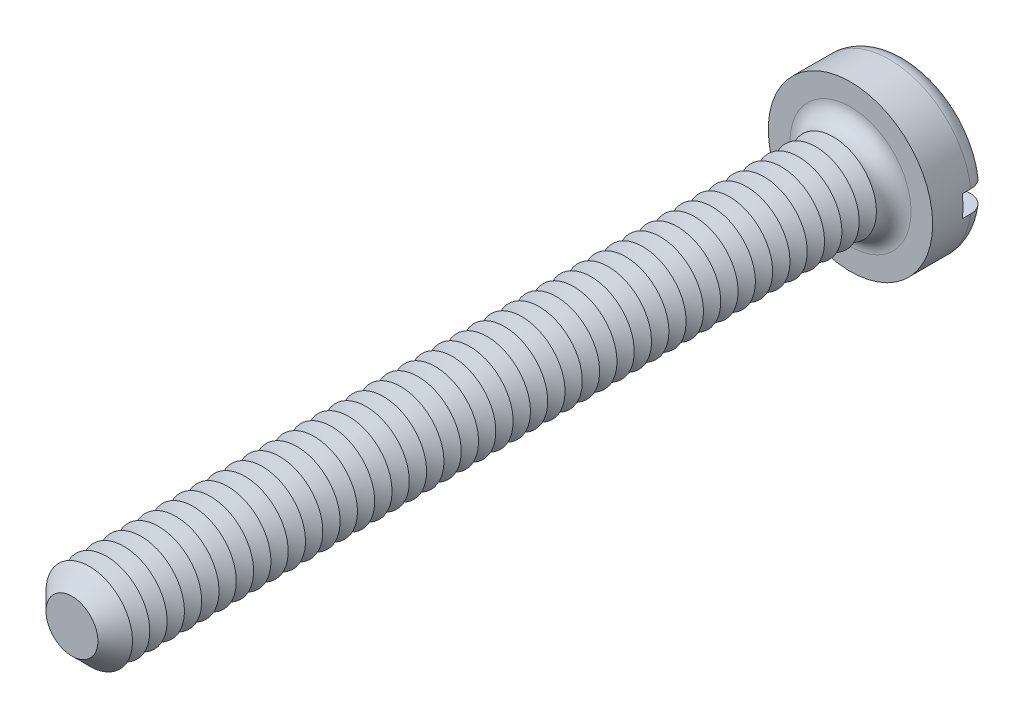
ISO-10303-21;
HEADER;
FILE_DESCRIPTION(('STEP AP214'),'2;1');
FILE_NAME('part.step','',(''),(''),'','','');
FILE_SCHEMA(('AUTOMOTIVE_DESIGN { 1 0 10303 214 1 1 1 1 }'));
ENDSEC;
DATA;
#1=APPLICATION_CONTEXT('core data for automotive mechanical design processes');
#2=APPLICATION_PROTOCOL_DEFINITION('international standard','automotive_design',2000,#1);
#3=PRODUCT_CONTEXT('',#1,'mechanical');
#4=PRODUCT('Part','Part','',(#3));
#5=PRODUCT_RELATED_PRODUCT_CATEGORY('part','',(#4));
#6=PRODUCT_DEFINITION_FORMATION('','',#4);
#7=PRODUCT_DEFINITION_CONTEXT('part definition',#1,'design');
#8=PRODUCT_DEFINITION('design','',#6,#7);
#9=PRODUCT_DEFINITION_SHAPE('','',#8);
#10=(LENGTH_UNIT() NAMED_UNIT(*) SI_UNIT(.MILLI.,.METRE.));
#11=(NAMED_UNIT(*) PLANE_ANGLE_UNIT() SI_UNIT($,.RADIAN.));
#12=(NAMED_UNIT(*) SI_UNIT($,.STERADIAN.) SOLID_ANGLE_UNIT());
#13=UNCERTAINTY_MEASURE_WITH_UNIT(LENGTH_MEASURE(1.E-05),#10,'distance_accuracy_value','');
#14=(GEOMETRIC_REPRESENTATION_CONTEXT(3) GLOBAL_UNCERTAINTY_ASSIGNED_CONTEXT((#13)) GLOBAL_UNIT_ASSIGNED_CONTEXT((#10,
#11,#12)) REPRESENTATION_CONTEXT('',''));
#15=CARTESIAN_POINT('',(0.,0.,0.));
#16=DIRECTION('',(0.,0.,1.));
#17=DIRECTION('',(1.,0.,0.));
#18=AXIS2_PLACEMENT_3D('',#15,#16,#17);
#19=CARTESIAN_POINT('',(0.,0.,-1.3));
#20=DIRECTION('',(0.,0.,1.));
#21=DIRECTION('',(1.,0.,0.));
#22=AXIS2_PLACEMENT_3D('',#19,#20,#21);
#23=PLANE('',#22);
#24=CARTESIAN_POINT('',(0.,0.,-1.3));
#25=DIRECTION('',(0.,0.,1.));
#26=DIRECTION('',(1.,0.,0.));
#27=AXIS2_PLACEMENT_3D('',#24,#25,#26);
#28=CIRCLE('',#27,1.5);
#29=CARTESIAN_POINT('',(-1.4790199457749,0.25,-1.3));
#30=VERTEX_POINT('',#29);
#31=CARTESIAN_POINT('',(1.4790199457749,0.25,-1.3));
#32=VERTEX_POINT('',#31);
#33=EDGE_CURVE('E116',#30,#32,#28,.F.);
#34=ORIENTED_EDGE('',*,*,#33,.T.);
#35=DIRECTION('',(1.,0.,0.));
#36=VECTOR('',#35,1.);
#37=CARTESIAN_POINT('',(-1.9,0.25,-1.3));
#38=LINE('',#37,#36);
#39=EDGE_CURVE('E111',#30,#32,#38,.T.);
#40=ORIENTED_EDGE('',*,*,#39,.F.);
#41=EDGE_LOOP('',(#34,#40));
#42=FACE_BOUND('',#41,.T.);
#43=ADVANCED_FACE('F39',(#42),#23,.F.);
#44=CARTESIAN_POINT('',(0.,0.,-0.9));
#45=DIRECTION('',(0.,0.,1.));
#46=DIRECTION('',(1.,0.,0.));
#47=AXIS2_PLACEMENT_3D('',#44,#45,#46);
#48=TOROIDAL_SURFACE('',#47,1.5,0.4);
#49=CARTESIAN_POINT('',(-1.8150392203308,0.25,-1.12284384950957));
#50=CARTESIAN_POINT('',(-1.80236980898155,0.25,-1.14155059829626));
#51=CARTESIAN_POINT('',(-1.78809920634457,0.25,-1.15919399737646));
#52=CARTESIAN_POINT('',(-1.75677844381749,0.25,-1.19184073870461));
#53=CARTESIAN_POINT('',(-1.73972468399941,0.25,-1.20684060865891));
#54=CARTESIAN_POINT('',(-1.70336024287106,0.25,-1.23375848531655));
#55=CARTESIAN_POINT('',(-1.68405164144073,0.25,-1.24567930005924));
#56=CARTESIAN_POINT('',(-1.64372549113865,0.25,-1.26613528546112));
#57=CARTESIAN_POINT('',(-1.6227083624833,0.25,-1.27467128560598));
#58=CARTESIAN_POINT('',(-1.57937988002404,0.25,-1.2881995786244));
#59=CARTESIAN_POINT('',(-1.55705957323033,0.25,-1.29316318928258));
#60=CARTESIAN_POINT('',(-1.51190394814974,0.25,-1.29931753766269));
#61=CARTESIAN_POINT('',(-1.48906857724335,0.25,-1.3005078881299));
#62=CARTESIAN_POINT('',(-1.4432641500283,0.25,-1.29909058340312));
#63=CARTESIAN_POINT('',(-1.42029638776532,0.25,-1.29644099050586));
#64=CARTESIAN_POINT('',(-1.37512297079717,0.25,-1.28735146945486));
#65=CARTESIAN_POINT('',(-1.3529173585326,0.25,-1.28091133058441));
#66=CARTESIAN_POINT('',(-1.30974098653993,0.25,-1.26436295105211));
#67=CARTESIAN_POINT('',(-1.28877978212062,0.25,-1.25422975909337));
#68=CARTESIAN_POINT('',(-1.24886205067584,0.25,-1.23057736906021));
#69=CARTESIAN_POINT('',(-1.22990554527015,0.25,-1.21705813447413));
#70=CARTESIAN_POINT('',(-1.19461911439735,0.25,-1.18704970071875));
#71=CARTESIAN_POINT('',(-1.17828051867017,0.25,-1.17057070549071));
#72=CARTESIAN_POINT('',(-1.14865897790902,0.25,-1.13506201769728));
#73=CARTESIAN_POINT('',(-1.13537576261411,0.25,-1.11603255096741));
#74=CARTESIAN_POINT('',(-1.11249827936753,0.25,-1.07630328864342));
#75=CARTESIAN_POINT('',(-1.10284494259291,0.25,-1.05563752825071));
#76=CARTESIAN_POINT('',(-1.08724024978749,0.25,-1.01295282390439));
#77=CARTESIAN_POINT('',(-1.08128829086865,0.25,-0.990934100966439));
#78=CARTESIAN_POINT('',(-1.07339124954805,0.25,-0.946722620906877));
#79=CARTESIAN_POINT('',(-1.07135558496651,0.25,-0.924546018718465));
#80=CARTESIAN_POINT('',(-1.07108722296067,0.25,-0.880170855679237));
#81=CARTESIAN_POINT('',(-1.07285419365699,0.25,-0.857972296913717));
#82=CARTESIAN_POINT('',(-1.0800838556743,0.25,-0.814463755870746));
#83=CARTESIAN_POINT('',(-1.08550159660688,0.25,-0.793146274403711));
#84=CARTESIAN_POINT('',(-1.09980522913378,0.25,-0.751709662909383));
#85=CARTESIAN_POINT('',(-1.10869126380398,0.25,-0.731590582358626));
#86=CARTESIAN_POINT('',(-1.12975121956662,0.25,-0.692901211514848));
#87=CARTESIAN_POINT('',(-1.14195627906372,0.25,-0.674347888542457));
#88=CARTESIAN_POINT('',(-1.1692428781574,0.25,-0.639494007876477));
#89=CARTESIAN_POINT('',(-1.18432473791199,0.25,-0.623193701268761));
#90=CARTESIAN_POINT('',(-1.21730350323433,0.25,-0.592916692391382));
#91=CARTESIAN_POINT('',(-1.23525650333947,0.25,-0.579001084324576));
#92=CARTESIAN_POINT('',(-1.27320799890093,0.25,-0.554314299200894));
#93=CARTESIAN_POINT('',(-1.2932067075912,0.25,-0.543543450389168));
#94=CARTESIAN_POINT('',(-1.33509120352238,0.25,-0.525253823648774));
#95=CARTESIAN_POINT('',(-1.35700545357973,0.25,-0.517800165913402));
#96=CARTESIAN_POINT('',(-1.401770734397,0.25,-0.506652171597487));
#97=CARTESIAN_POINT('',(-1.42462180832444,0.25,-0.502958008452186));
#98=CARTESIAN_POINT('',(-1.4707602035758,0.25,-0.499429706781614));
#99=CARTESIAN_POINT('',(-1.49404932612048,0.25,-0.499619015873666));
#100=CARTESIAN_POINT('',(-1.54026206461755,0.25,-0.50392615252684));
#101=CARTESIAN_POINT('',(-1.56318568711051,0.25,-0.508043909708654));
#102=CARTESIAN_POINT('',(-1.60788420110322,0.25,-0.520077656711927));
#103=CARTESIAN_POINT('',(-1.6296645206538,0.25,-0.527973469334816));
#104=CARTESIAN_POINT('',(-1.67156889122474,0.25,-0.547348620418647));
#105=CARTESIAN_POINT('',(-1.69169302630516,0.25,-0.558827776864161));
#106=CARTESIAN_POINT('',(-1.72948251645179,0.25,-0.584913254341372));
#107=CARTESIAN_POINT('',(-1.74717189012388,0.25,-0.599484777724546));
#108=CARTESIAN_POINT('',(-1.77981909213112,0.25,-0.63142070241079));
#109=CARTESIAN_POINT('',(-1.79477707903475,0.25,-0.648784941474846));
#110=CARTESIAN_POINT('',(-1.82136524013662,0.25,-0.685607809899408));
#111=CARTESIAN_POINT('',(-1.83303003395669,0.25,-0.705041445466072));
#112=CARTESIAN_POINT('',(-1.85289960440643,0.25,-0.745602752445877));
#113=CARTESIAN_POINT('',(-1.86110468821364,0.25,-0.76673027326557));
#114=CARTESIAN_POINT('',(-1.87375648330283,0.25,-0.809891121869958));
#115=CARTESIAN_POINT('',(-1.87823381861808,0.25,-0.831915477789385));
#116=CARTESIAN_POINT('',(-1.88341152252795,0.25,-0.87640983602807));
#117=CARTESIAN_POINT('',(-1.88411103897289,0.25,-0.898879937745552));
#118=CARTESIAN_POINT('',(-1.88171559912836,0.25,-0.943534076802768));
#119=CARTESIAN_POINT('',(-1.87863413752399,0.25,-0.965718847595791));
#120=CARTESIAN_POINT('',(-1.86879153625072,0.25,-1.00923650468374));
#121=CARTESIAN_POINT('',(-1.86203494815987,0.25,-1.03057040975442));
#122=CARTESIAN_POINT('',(-1.84837477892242,0.25,-1.06373797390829));
#123=CARTESIAN_POINT('',(-1.84255723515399,0.25,-1.07603047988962));
#124=CARTESIAN_POINT('',(-1.82969924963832,0.25,-1.09995814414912));
#125=CARTESIAN_POINT('',(-1.82265881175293,0.25,-1.11159330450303));
#126=CARTESIAN_POINT('',(-1.8150392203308,0.25,-1.12284384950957));
#127=B_SPLINE_CURVE_WITH_KNOTS('',3,(#49,#50,#51,#52,#53,#54,#55,#56,#57,#58,#59,#60,#61,#62,
#63,#64,#65,#66,#67,#68,#69,#70,#71,#72,#73,#74,#75,#76,#77,#78,#79,#80,#81,#82,#83,#84,#85,#86,
#87,#88,#89,#90,#91,#92,#93,#94,#95,#96,#97,#98,#99,#100,#101,#102,#103,#104,#105,#106,#107,
#108,#109,#110,#111,#112,#113,#114,#115,#116,#117,#118,#119,#120,#121,#122,#123,#124,#125,#126),
.UNSPECIFIED.,.T.,.F.,(4,2,2,2,2,2,2,2,2,2,2,2,2,2,2,2,2,2,2,2,2,2,2,2,2,2,2,2,2,2,2,2,2,2,2,2,
2,2,4),(0.,0.0677296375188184,0.135547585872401,0.203303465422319,0.27104273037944,
0.339319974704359,0.407604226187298,0.47663988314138,0.545679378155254,0.615194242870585,
0.684709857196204,0.753990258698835,0.82326452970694,0.891356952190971,0.959438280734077,
1.02592503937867,1.0924059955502,1.15808300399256,1.2237627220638,1.29008126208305,
1.35640718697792,1.4242376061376,1.49207510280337,1.5611911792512,1.63031044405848,
1.69984715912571,1.76938262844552,1.8385508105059,1.90771547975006,1.97613962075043,
2.04455978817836,2.11223135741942,2.17989691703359,2.24700094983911,2.31412011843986,
2.38100042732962,2.44779809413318,2.48853193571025,2.52926564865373),.UNSPECIFIED.);
#128=CARTESIAN_POINT('',(-1.88348082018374,0.25,-0.9));
#129=VERTEX_POINT('',#128);
#130=EDGE_CURVE('E523',#129,#30,#127,.T.);
#131=ORIENTED_EDGE('',*,*,#130,.F.);
#132=CARTESIAN_POINT('',(0.,0.,-0.9));
#133=DIRECTION('',(0.,0.,1.));
#134=DIRECTION('',(1.,0.,0.));
#135=AXIS2_PLACEMENT_3D('',#132,#133,#134);
#136=CIRCLE('',#135,1.9);
#137=CARTESIAN_POINT('',(1.88348082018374,0.25,-0.9));
#138=VERTEX_POINT('',#137);
#139=EDGE_CURVE('E125',#138,#129,#136,.T.);
#140=ORIENTED_EDGE('',*,*,#139,.F.);
#141=CARTESIAN_POINT('',(1.11362660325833,0.25,-1.07710243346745));
#142=CARTESIAN_POINT('',(1.12388366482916,0.25,-1.09736755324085));
#143=CARTESIAN_POINT('',(1.13589127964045,0.25,-1.11676768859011));
#144=CARTESIAN_POINT('',(1.16301945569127,0.25,-1.15328107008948));
#145=CARTESIAN_POINT('',(1.17814463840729,0.25,-1.17039085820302));
#146=CARTESIAN_POINT('',(1.21101661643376,0.25,-1.20182395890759));
#147=CARTESIAN_POINT('',(1.22875976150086,0.25,-1.21615108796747));
#148=CARTESIAN_POINT('',(1.26636392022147,0.25,-1.24166932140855));
#149=CARTESIAN_POINT('',(1.28622436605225,0.25,-1.25286126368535));
#150=CARTESIAN_POINT('',(1.32781377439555,0.25,-1.27196191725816));
#151=CARTESIAN_POINT('',(1.34956550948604,0.25,-1.27982107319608));
#152=CARTESIAN_POINT('',(1.39407620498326,0.25,-1.29180513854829));
#153=CARTESIAN_POINT('',(1.41683526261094,0.25,-1.29592968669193));
#154=CARTESIAN_POINT('',(1.46288034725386,0.25,-1.3003367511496));
#155=CARTESIAN_POINT('',(1.48616890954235,0.25,-1.30059287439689));
#156=CARTESIAN_POINT('',(1.53245605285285,0.25,-1.29717239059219));
#157=CARTESIAN_POINT('',(1.55545463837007,0.25,-1.29349584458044));
#158=CARTESIAN_POINT('',(1.60038828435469,0.25,-1.28232271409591));
#159=CARTESIAN_POINT('',(1.62232790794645,0.25,-1.27484449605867));
#160=CARTESIAN_POINT('',(1.66461970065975,0.25,-1.25627203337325));
#161=CARTESIAN_POINT('',(1.68497195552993,0.25,-1.24517798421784));
#162=CARTESIAN_POINT('',(1.72328060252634,0.25,-1.21981269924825));
#163=CARTESIAN_POINT('',(1.74126001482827,0.25,-1.2055762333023));
#164=CARTESIAN_POINT('',(1.77453973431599,0.25,-1.17425606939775));
#165=CARTESIAN_POINT('',(1.78984019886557,0.25,-1.1571725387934));
#166=CARTESIAN_POINT('',(1.81715014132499,0.25,-1.12084732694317));
#167=CARTESIAN_POINT('',(1.82919410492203,0.25,-1.10163156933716));
#168=CARTESIAN_POINT('',(1.84985315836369,0.25,-1.06143759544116));
#169=CARTESIAN_POINT('',(1.85846842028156,0.25,-1.04045946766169));
#170=CARTESIAN_POINT('',(1.87195437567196,0.25,-0.997526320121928));
#171=CARTESIAN_POINT('',(1.87685590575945,0.25,-0.975580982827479));
#172=CARTESIAN_POINT('',(1.88288741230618,0.25,-0.931178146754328));
#173=CARTESIAN_POINT('',(1.88401750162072,0.25,-0.908720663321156));
#174=CARTESIAN_POINT('',(1.88247598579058,0.25,-0.864033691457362));
#175=CARTESIAN_POINT('',(1.87982069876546,0.25,-0.841803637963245));
#176=CARTESIAN_POINT('',(1.87081646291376,0.25,-0.798104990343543));
#177=CARTESIAN_POINT('',(1.86446754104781,0.25,-0.776636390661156));
#178=CARTESIAN_POINT('',(1.84826063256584,0.25,-0.735060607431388));
#179=CARTESIAN_POINT('',(1.83840161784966,0.25,-0.714953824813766));
#180=CARTESIAN_POINT('',(1.81546327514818,0.25,-0.676670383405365));
#181=CARTESIAN_POINT('',(1.80238389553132,0.25,-0.658493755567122));
#182=CARTESIAN_POINT('',(1.77331327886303,0.25,-0.62448916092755));
#183=CARTESIAN_POINT('',(1.75730833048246,0.25,-0.608672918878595));
#184=CARTESIAN_POINT('',(1.72289038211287,0.25,-0.579924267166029));
#185=CARTESIAN_POINT('',(1.70447729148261,0.25,-0.566991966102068));
#186=CARTESIAN_POINT('',(1.66559643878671,0.25,-0.544254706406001));
#187=CARTESIAN_POINT('',(1.64511218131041,0.25,-0.53447796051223));
#188=CARTESIAN_POINT('',(1.60280554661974,0.25,-0.518459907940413));
#189=CARTESIAN_POINT('',(1.58098309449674,0.25,-0.512218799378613));
#190=CARTESIAN_POINT('',(1.53636184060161,0.25,-0.503375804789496));
#191=CARTESIAN_POINT('',(1.51355490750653,0.25,-0.500814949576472));
#192=CARTESIAN_POINT('',(1.46783245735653,0.25,-0.499516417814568));
#193=CARTESIAN_POINT('',(1.44491693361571,0.25,-0.500778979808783));
#194=CARTESIAN_POINT('',(1.39937748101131,0.25,-0.50711284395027));
#195=CARTESIAN_POINT('',(1.37675897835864,0.25,-0.512223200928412));
#196=CARTESIAN_POINT('',(1.33269286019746,0.25,-0.526151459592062));
#197=CARTESIAN_POINT('',(1.31124530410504,0.25,-0.534969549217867));
#198=CARTESIAN_POINT('',(1.27004097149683,0.25,-0.556118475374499));
#199=CARTESIAN_POINT('',(1.25029179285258,0.25,-0.568464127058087));
#200=CARTESIAN_POINT('',(1.21316554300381,0.25,-0.59631968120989));
#201=CARTESIAN_POINT('',(1.19578844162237,0.25,-0.611829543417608));
#202=CARTESIAN_POINT('',(1.16406059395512,0.25,-0.645459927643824));
#203=CARTESIAN_POINT('',(1.14968747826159,0.25,-0.663559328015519));
#204=CARTESIAN_POINT('',(1.12425968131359,0.25,-0.70195566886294));
#205=CARTESIAN_POINT('',(1.11320445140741,0.25,-0.722252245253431));
#206=CARTESIAN_POINT('',(1.09497726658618,0.25,-0.764020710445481));
#207=CARTESIAN_POINT('',(1.08772970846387,0.25,-0.785459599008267));
#208=CARTESIAN_POINT('',(1.07702618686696,0.25,-0.829269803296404));
#209=CARTESIAN_POINT('',(1.07357062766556,0.25,-0.851641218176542));
#210=CARTESIAN_POINT('',(1.07060826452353,0.25,-0.896160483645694));
#211=CARTESIAN_POINT('',(1.07101876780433,0.25,-0.918302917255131));
#212=CARTESIAN_POINT('',(1.07557730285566,0.25,-0.962179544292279));
#213=CARTESIAN_POINT('',(1.07972048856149,0.25,-0.983914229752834));
#214=CARTESIAN_POINT('',(1.08912066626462,0.25,-1.01754924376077));
#215=CARTESIAN_POINT('',(1.09320341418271,0.25,-1.02979035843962));
#216=CARTESIAN_POINT('',(1.10254493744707,0.25,-1.05381470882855));
#217=CARTESIAN_POINT('',(1.10780368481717,0.25,-1.06559795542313));
#218=CARTESIAN_POINT('',(1.11362660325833,0.25,-1.07710243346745));
#219=B_SPLINE_CURVE_WITH_KNOTS('',3,(#141,#142,#143,#144,#145,#146,#147,#148,#149,#150,#151,
#152,#153,#154,#155,#156,#157,#158,#159,#160,#161,#162,#163,#164,#165,#166,#167,#168,#169,#170,
#171,#172,#173,#174,#175,#176,#177,#178,#179,#180,#181,#182,#183,#184,#185,#186,#187,#188,#189,
#190,#191,#192,#193,#194,#195,#196,#197,#198,#199,#200,#201,#202,#203,#204,#205,#206,#207,#208,
#209,#210,#211,#212,#213,#214,#215,#216,#217,#218),.UNSPECIFIED.,.T.,.F.,(4,2,2,2,2,2,2,2,2,2,2,
2,2,2,2,2,2,2,2,2,2,2,2,2,2,2,2,2,2,2,2,2,2,2,2,2,2,2,4),(0.,0.0680907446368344,
0.136283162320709,0.204381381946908,0.272461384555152,0.341520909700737,0.410587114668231,
0.480124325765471,0.549660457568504,0.618863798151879,0.688063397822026,0.756532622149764,
0.824997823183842,0.892706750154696,0.960412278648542,1.02754926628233,1.09468424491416,
1.16153068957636,1.22837664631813,1.29524219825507,1.36210882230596,1.42929726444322,
1.49648823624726,1.56426429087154,1.63204414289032,1.70057395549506,1.76910804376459,
1.83834728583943,1.90759003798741,1.97712798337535,2.0466650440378,2.11566422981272,
2.18465199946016,2.25221259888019,2.3197804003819,2.38590630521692,2.45194648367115,
2.49060241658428,2.5292574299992),.UNSPECIFIED.);
#220=EDGE_CURVE('E525',#32,#138,#219,.T.);
#221=ORIENTED_EDGE('',*,*,#220,.F.);
#222=ORIENTED_EDGE('',*,*,#33,.F.);
#223=EDGE_LOOP('',(#131,#140,#221,#222));
#224=FACE_BOUND('',#223,.T.);
#225=ADVANCED_FACE('F507',(#224),#48,.T.);
#226=CARTESIAN_POINT('',(0.,0.,-1.3));
#227=DIRECTION('',(0.,0.,1.));
#228=DIRECTION('',(1.,0.,0.));
#229=AXIS2_PLACEMENT_3D('',#226,#227,#228);
#230=CYLINDRICAL_SURFACE('',#229,1.9);
#231=DIRECTION('',(0.,0.,1.));
#232=VECTOR('',#231,1.);
#233=CARTESIAN_POINT('',(1.88348082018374,0.25,-1.3));
#234=LINE('',#233,#232);
#235=CARTESIAN_POINT('',(1.88348082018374,0.25,-0.7));
#236=VERTEX_POINT('',#235);
#237=EDGE_CURVE('E538',#138,#236,#234,.T.);
#238=ORIENTED_EDGE('',*,*,#237,.F.);
#239=ORIENTED_EDGE('',*,*,#139,.T.);
#240=DIRECTION('',(0.,0.,1.));
#241=VECTOR('',#240,1.);
#242=CARTESIAN_POINT('',(-1.88348082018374,0.25,-1.3));
#243=LINE('',#242,#241);
#244=CARTESIAN_POINT('',(-1.88348082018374,0.25,-0.7));
#245=VERTEX_POINT('',#244);
#246=EDGE_CURVE('E63',#245,#129,#243,.F.);
#247=ORIENTED_EDGE('',*,*,#246,.F.);
#248=CARTESIAN_POINT('',(0.,0.,-0.7));
#249=DIRECTION('',(0.,0.,-1.));
#250=DIRECTION('',(-1.,0.,0.));
#251=AXIS2_PLACEMENT_3D('',#248,#249,#250);
#252=CIRCLE('',#251,1.9);
#253=CARTESIAN_POINT('',(-1.88348082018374,-0.25,-0.7));
#254=VERTEX_POINT('',#253);
#255=EDGE_CURVE('E43',#245,#254,#252,.F.);
#256=ORIENTED_EDGE('',*,*,#255,.T.);
#257=DIRECTION('',(0.,0.,1.));
#258=VECTOR('',#257,1.);
#259=CARTESIAN_POINT('',(-1.88348082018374,-0.25,-1.3));
#260=LINE('',#259,#258);
#261=CARTESIAN_POINT('',(-1.88348082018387,-0.25,-0.899999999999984));
#262=VERTEX_POINT('',#261);
#263=EDGE_CURVE('E535',#262,#254,#260,.T.);
#264=ORIENTED_EDGE('',*,*,#263,.F.);
#265=CARTESIAN_POINT('',(1.88348082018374,-0.25,-0.9));
#266=VERTEX_POINT('',#265);
#267=EDGE_CURVE('E127',#262,#266,#136,.T.);
#268=ORIENTED_EDGE('',*,*,#267,.T.);
#269=DIRECTION('',(0.,0.,1.));
#270=VECTOR('',#269,1.);
#271=CARTESIAN_POINT('',(1.88348082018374,-0.25,-1.3));
#272=LINE('',#271,#270);
#273=CARTESIAN_POINT('',(1.88348082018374,-0.25,-0.7));
#274=VERTEX_POINT('',#273);
#275=EDGE_CURVE('E55',#274,#266,#272,.F.);
#276=ORIENTED_EDGE('',*,*,#275,.F.);
#277=EDGE_CURVE('E11',#274,#236,#252,.F.);
#278=ORIENTED_EDGE('',*,*,#277,.T.);
#279=EDGE_LOOP('',(#238,#239,#247,#256,#264,#268,#276,#278));
#280=FACE_BOUND('',#279,.T.);
#281=CARTESIAN_POINT('',(0.,0.,0.));
#282=DIRECTION('',(0.,0.,1.));
#283=DIRECTION('',(1.,0.,0.));
#284=AXIS2_PLACEMENT_3D('',#281,#282,#283);
#285=CIRCLE('',#284,1.9);
#286=CARTESIAN_POINT('',(1.9,0.,0.));
#287=VERTEX_POINT('',#286);
#288=EDGE_CURVE('E541',#287,#287,#285,.T.);
#289=ORIENTED_EDGE('',*,*,#288,.F.);
#290=EDGE_LOOP('',(#289));
#291=FACE_BOUND('',#290,.T.);
#292=ADVANCED_FACE('F503',(#280,#291),#230,.T.);
#293=CARTESIAN_POINT('',(1.4790199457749,-0.25,-1.3));
#294=VERTEX_POINT('',#293);
#295=CARTESIAN_POINT('',(-1.4790199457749,-0.25,-1.3));
#296=VERTEX_POINT('',#295);
#297=EDGE_CURVE('E109',#294,#296,#28,.F.);
#298=ORIENTED_EDGE('',*,*,#297,.T.);
#299=DIRECTION('',(-1.,0.,0.));
#300=VECTOR('',#299,1.);
#301=CARTESIAN_POINT('',(-1.9,-0.25,-1.3));
#302=LINE('',#301,#300);
#303=EDGE_CURVE('E96',#294,#296,#302,.T.);
#304=ORIENTED_EDGE('',*,*,#303,.F.);
#305=EDGE_LOOP('',(#298,#304));
#306=FACE_BOUND('',#305,.T.);
#307=ADVANCED_FACE('F108',(#306),#23,.F.);
#308=CARTESIAN_POINT('',(0.,0.,0.));
#309=DIRECTION('',(0.,0.,1.));
#310=DIRECTION('',(1.,0.,0.));
#311=AXIS2_PLACEMENT_3D('',#308,#309,#310);
#312=PLANE('',#311);
#313=CARTESIAN_POINT('',(0.,0.,0.));
#314=DIRECTION('',(0.,0.,1.));
#315=DIRECTION('',(1.,0.,0.));
#316=AXIS2_PLACEMENT_3D('',#313,#314,#315);
#317=CIRCLE('',#316,1.4);
#318=CARTESIAN_POINT('',(1.4,0.,0.));
#319=VERTEX_POINT('',#318);
#320=EDGE_CURVE('E115',#319,#319,#317,.F.);
#321=ORIENTED_EDGE('',*,*,#320,.T.);
#322=EDGE_LOOP('',(#321));
#323=FACE_BOUND('',#322,.T.);
#324=ORIENTED_EDGE('',*,*,#288,.T.);
#325=EDGE_LOOP('',(#324));
#326=FACE_BOUND('',#325,.T.);
#327=ADVANCED_FACE('F502',(#323,#326),#312,.T.);
#328=CARTESIAN_POINT('',(-1.8150392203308,-0.25,-1.12284384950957));
#329=CARTESIAN_POINT('',(-1.82756185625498,-0.25,-1.10435021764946));
#330=CARTESIAN_POINT('',(-1.83853807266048,-0.25,-1.08479072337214));
#331=CARTESIAN_POINT('',(-1.85706233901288,-0.25,-1.04409188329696));
#332=CARTESIAN_POINT('',(-1.86460655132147,-0.25,-1.02295079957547));
#333=CARTESIAN_POINT('',(-1.87603074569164,-0.25,-0.979704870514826));
#334=CARTESIAN_POINT('',(-1.87991177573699,-0.25,-0.957600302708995));
#335=CARTESIAN_POINT('',(-1.88389586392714,-0.25,-0.913058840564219));
#336=CARTESIAN_POINT('',(-1.88399981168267,-0.25,-0.890622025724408));
#337=CARTESIAN_POINT('',(-1.88043374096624,-0.25,-0.846104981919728));
#338=CARTESIAN_POINT('',(-1.87677281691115,-0.25,-0.824024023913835));
#339=CARTESIAN_POINT('',(-1.86579880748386,-0.25,-0.780788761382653));
#340=CARTESIAN_POINT('',(-1.85848560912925,-0.25,-0.759634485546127));
#341=CARTESIAN_POINT('',(-1.8404137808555,-0.25,-0.718830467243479));
#342=CARTESIAN_POINT('',(-1.82965205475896,-0.25,-0.699182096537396));
#343=CARTESIAN_POINT('',(-1.80499939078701,-0.25,-0.661958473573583));
#344=CARTESIAN_POINT('',(-1.7911083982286,-0.25,-0.644383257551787));
#345=CARTESIAN_POINT('',(-1.76051564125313,-0.25,-0.611699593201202));
#346=CARTESIAN_POINT('',(-1.74379913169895,-0.25,-0.596604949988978));
#347=CARTESIAN_POINT('',(-1.70808901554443,-0.25,-0.569406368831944));
#348=CARTESIAN_POINT('',(-1.68909532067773,-0.25,-0.557302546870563));
#349=CARTESIAN_POINT('',(-1.64918615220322,-0.25,-0.536307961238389));
#350=CARTESIAN_POINT('',(-1.62825469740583,-0.25,-0.527447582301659));
#351=CARTESIAN_POINT('',(-1.58521203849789,-0.25,-0.513323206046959));
#352=CARTESIAN_POINT('',(-1.5631007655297,-0.25,-0.508059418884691));
#353=CARTESIAN_POINT('',(-1.51806209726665,-0.25,-0.501215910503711));
#354=CARTESIAN_POINT('',(-1.4951283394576,-0.25,-0.499678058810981));
#355=CARTESIAN_POINT('',(-1.4493239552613,-0.25,-0.500434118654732));
#356=CARTESIAN_POINT('',(-1.4264533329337,-0.25,-0.502728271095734));
#357=CARTESIAN_POINT('',(-1.38118643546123,-0.25,-0.511115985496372));
#358=CARTESIAN_POINT('',(-1.35879703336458,-0.25,-0.51724667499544));
#359=CARTESIAN_POINT('',(-1.31535851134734,-0.25,-0.533167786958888));
#360=CARTESIAN_POINT('',(-1.29430945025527,-0.25,-0.542958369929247));
#361=CARTESIAN_POINT('',(-1.25409242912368,-0.25,-0.565968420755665));
#362=CARTESIAN_POINT('',(-1.23493023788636,-0.25,-0.579197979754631));
#363=CARTESIAN_POINT('',(-1.19912477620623,-0.25,-0.608715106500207));
#364=CARTESIAN_POINT('',(-1.18248143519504,-0.25,-0.625002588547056));
#365=CARTESIAN_POINT('',(-1.15237533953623,-0.25,-0.660018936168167));
#366=CARTESIAN_POINT('',(-1.13888343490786,-0.25,-0.678722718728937));
#367=CARTESIAN_POINT('',(-1.115312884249,-0.25,-0.718170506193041));
#368=CARTESIAN_POINT('',(-1.10523377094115,-0.25,-0.738914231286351));
#369=CARTESIAN_POINT('',(-1.08901310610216,-0.25,-0.781372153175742));
#370=CARTESIAN_POINT('',(-1.08279080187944,-0.25,-0.803055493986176));
#371=CARTESIAN_POINT('',(-1.07416105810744,-0.25,-0.847167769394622));
#372=CARTESIAN_POINT('',(-1.07175306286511,-0.25,-0.869596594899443));
#373=CARTESIAN_POINT('',(-1.07084656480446,-0.25,-0.914070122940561));
#374=CARTESIAN_POINT('',(-1.07226874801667,-0.25,-0.936113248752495));
#375=CARTESIAN_POINT('',(-1.07880428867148,-0.25,-0.979644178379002));
#376=CARTESIAN_POINT('',(-1.08391755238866,-0.25,-1.00113199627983));
#377=CARTESIAN_POINT('',(-1.09764616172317,-0.25,-1.04290115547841));
#378=CARTESIAN_POINT('',(-1.10625346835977,-0.25,-1.06318514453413));
#379=CARTESIAN_POINT('',(-1.12669365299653,-0.25,-1.10205584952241));
#380=CARTESIAN_POINT('',(-1.13852679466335,-0.25,-1.12064242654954));
#381=CARTESIAN_POINT('',(-1.16529672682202,-0.25,-1.15594801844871));
#382=CARTESIAN_POINT('',(-1.18028464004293,-0.25,-1.17262825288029));
#383=CARTESIAN_POINT('',(-1.21279183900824,-0.25,-1.20330600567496));
#384=CARTESIAN_POINT('',(-1.23031142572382,-0.25,-1.21730320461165));
#385=CARTESIAN_POINT('',(-1.26781695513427,-0.25,-1.24254670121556));
#386=CARTESIAN_POINT('',(-1.28784999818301,-0.25,-1.25372305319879));
#387=CARTESIAN_POINT('',(-1.3294899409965,-0.25,-1.27260611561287));
#388=CARTESIAN_POINT('',(-1.35109697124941,-0.25,-1.28031253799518));
#389=CARTESIAN_POINT('',(-1.39558575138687,-0.25,-1.29212626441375));
#390=CARTESIAN_POINT('',(-1.4184807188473,-0.25,-1.29618386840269));
#391=CARTESIAN_POINT('',(-1.4646266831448,-0.25,-1.30039947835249));
#392=CARTESIAN_POINT('',(-1.48787767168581,-0.25,-1.30055757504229));
#393=CARTESIAN_POINT('',(-1.53407883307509,-0.25,-1.29695468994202));
#394=CARTESIAN_POINT('',(-1.55702895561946,-0.25,-1.29319306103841));
#395=CARTESIAN_POINT('',(-1.60196718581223,-0.25,-1.28183520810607));
#396=CARTESIAN_POINT('',(-1.62395508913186,-0.25,-1.27423817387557));
#397=CARTESIAN_POINT('',(-1.66614393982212,-0.25,-1.25548646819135));
#398=CARTESIAN_POINT('',(-1.68635782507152,-0.25,-1.24436087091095));
#399=CARTESIAN_POINT('',(-1.72458266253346,-0.25,-1.21884344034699));
#400=CARTESIAN_POINT('',(-1.74259637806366,-0.25,-1.20445577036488));
#401=CARTESIAN_POINT('',(-1.76968989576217,-0.25,-1.1787247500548));
#402=CARTESIAN_POINT('',(-1.77959984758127,-0.25,-1.1682407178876));
#403=CARTESIAN_POINT('',(-1.79823423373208,-0.25,-1.14626700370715));
#404=CARTESIAN_POINT('',(-1.80695867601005,-0.25,-1.1347773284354));
#405=CARTESIAN_POINT('',(-1.8150392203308,-0.25,-1.12284384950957));
#406=B_SPLINE_CURVE_WITH_KNOTS('',3,(#328,#329,#330,#331,#332,#333,#334,#335,#336,#337,#338,
#339,#340,#341,#342,#343,#344,#345,#346,#347,#348,#349,#350,#351,#352,#353,#354,#355,#356,#357,
#358,#359,#360,#361,#362,#363,#364,#365,#366,#367,#368,#369,#370,#371,#372,#373,#374,#375,#376,
#377,#378,#379,#380,#381,#382,#383,#384,#385,#386,#387,#388,#389,#390,#391,#392,#393,#394,#395,
#396,#397,#398,#399,#400,#401,#402,#403,#404,#405),.UNSPECIFIED.,.T.,.F.,(4,2,2,2,2,2,2,2,2,2,2,
2,2,2,2,2,2,2,2,2,2,2,2,2,2,2,2,2,2,2,2,2,2,2,2,2,2,2,4),(0.,0.0669512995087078,
0.133977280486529,0.200984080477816,0.267975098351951,0.334804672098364,0.401636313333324,
0.468528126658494,0.535421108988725,0.602674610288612,0.669930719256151,0.737801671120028,
0.805676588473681,0.87431077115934,0.942949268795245,1.0122625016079,1.08157877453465,
1.15110078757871,1.22062085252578,1.28946987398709,1.35830946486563,1.42565417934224,
1.49298908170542,1.55894041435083,1.62489007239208,1.69068884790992,1.75649300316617,
1.82345932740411,1.89043361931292,1.95893391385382,2.02743989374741,2.09686543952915,
2.16628937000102,2.23572476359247,2.3051748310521,2.3740669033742,2.44287154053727,
2.48607383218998,2.52927583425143),.UNSPECIFIED.);
#407=EDGE_CURVE('E103',#296,#262,#406,.T.);
#408=ORIENTED_EDGE('',*,*,#407,.F.);
#409=ORIENTED_EDGE('',*,*,#297,.F.);
#410=CARTESIAN_POINT('',(1.11362660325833,-0.25,-1.07710243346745));
#411=CARTESIAN_POINT('',(1.10368387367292,-0.25,-1.05745397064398));
#412=CARTESIAN_POINT('',(1.09537204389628,-0.25,-1.0369644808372));
#413=CARTESIAN_POINT('',(1.08229212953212,-0.25,-0.994867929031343));
#414=CARTESIAN_POINT('',(1.07752732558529,-0.25,-0.973259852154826));
#415=CARTESIAN_POINT('',(1.07171197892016,-0.25,-0.929545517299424));
#416=CARTESIAN_POINT('',(1.07066166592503,-0.25,-0.907439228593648));
#417=CARTESIAN_POINT('',(1.07231382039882,-0.25,-0.863372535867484));
#418=CARTESIAN_POINT('',(1.07501551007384,-0.25,-0.841412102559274));
#419=CARTESIAN_POINT('',(1.08404966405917,-0.25,-0.798386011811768));
#420=CARTESIAN_POINT('',(1.09036099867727,-0.25,-0.777315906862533));
#421=CARTESIAN_POINT('',(1.10638973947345,-0.25,-0.736514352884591));
#422=CARTESIAN_POINT('',(1.11610743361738,-0.25,-0.716783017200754));
#423=CARTESIAN_POINT('',(1.13878208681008,-0.25,-0.678952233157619));
#424=CARTESIAN_POINT('',(1.15177705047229,-0.25,-0.660875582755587));
#425=CARTESIAN_POINT('',(1.18055347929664,-0.25,-0.62709692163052));
#426=CARTESIAN_POINT('',(1.19633525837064,-0.25,-0.611395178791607));
#427=CARTESIAN_POINT('',(1.23062926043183,-0.25,-0.582430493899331));
#428=CARTESIAN_POINT('',(1.24919608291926,-0.25,-0.569232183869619));
#429=CARTESIAN_POINT('',(1.28825118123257,-0.25,-0.546076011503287));
#430=CARTESIAN_POINT('',(1.30873964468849,-0.25,-0.536118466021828));
#431=CARTESIAN_POINT('',(1.35144534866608,-0.25,-0.519560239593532));
#432=CARTESIAN_POINT('',(1.3736865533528,-0.25,-0.513021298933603));
#433=CARTESIAN_POINT('',(1.41894945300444,-0.25,-0.503751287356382));
#434=CARTESIAN_POINT('',(1.44197117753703,-0.25,-0.50102036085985));
#435=CARTESIAN_POINT('',(1.48824913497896,-0.25,-0.499449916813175));
#436=CARTESIAN_POINT('',(1.5115059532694,-0.25,-0.500627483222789));
#437=CARTESIAN_POINT('',(1.55748678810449,-0.25,-0.506895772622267));
#438=CARTESIAN_POINT('',(1.58021081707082,-0.25,-0.511986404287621));
#439=CARTESIAN_POINT('',(1.6243247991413,-0.25,-0.525910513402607));
#440=CARTESIAN_POINT('',(1.64572225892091,-0.25,-0.534720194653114));
#441=CARTESIAN_POINT('',(1.68671060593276,-0.25,-0.555845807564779));
#442=CARTESIAN_POINT('',(1.70630159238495,-0.25,-0.568161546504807));
#443=CARTESIAN_POINT('',(1.74289060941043,-0.25,-0.595805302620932));
#444=CARTESIAN_POINT('',(1.75991474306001,-0.25,-0.611098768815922));
#445=CARTESIAN_POINT('',(1.79111916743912,-0.25,-0.644354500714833));
#446=CARTESIAN_POINT('',(1.80529962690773,-0.25,-0.662316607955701));
#447=CARTESIAN_POINT('',(1.83025525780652,-0.25,-0.700191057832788));
#448=CARTESIAN_POINT('',(1.84106535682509,-0.25,-0.720080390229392));
#449=CARTESIAN_POINT('',(1.8591630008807,-0.25,-0.761401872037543));
#450=CARTESIAN_POINT('',(1.86645070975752,-0.25,-0.782833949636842));
#451=CARTESIAN_POINT('',(1.87724305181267,-0.25,-0.826454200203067));
#452=CARTESIAN_POINT('',(1.88077646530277,-0.25,-0.848635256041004));
#453=CARTESIAN_POINT('',(1.88405487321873,-0.25,-0.89327539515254));
#454=CARTESIAN_POINT('',(1.88379996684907,-0.25,-0.915734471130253));
#455=CARTESIAN_POINT('',(1.87951702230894,-0.25,-0.96021054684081));
#456=CARTESIAN_POINT('',(1.87550211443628,-0.25,-0.982228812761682));
#457=CARTESIAN_POINT('',(1.86383665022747,-0.25,-1.0252797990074));
#458=CARTESIAN_POINT('',(1.85618610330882,-0.25,-1.04631252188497));
#459=CARTESIAN_POINT('',(1.83746332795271,-0.25,-1.08682395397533));
#460=CARTESIAN_POINT('',(1.82638722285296,-0.25,-1.10630087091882));
#461=CARTESIAN_POINT('',(1.80113946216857,-0.25,-1.14313202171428));
#462=CARTESIAN_POINT('',(1.78696774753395,-0.25,-1.1604862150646));
#463=CARTESIAN_POINT('',(1.75585044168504,-0.25,-1.19268694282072));
#464=CARTESIAN_POINT('',(1.73888979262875,-0.25,-1.20751892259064));
#465=CARTESIAN_POINT('',(1.7027387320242,-0.25,-1.23415579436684));
#466=CARTESIAN_POINT('',(1.68354822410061,-0.25,-1.24596055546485));
#467=CARTESIAN_POINT('',(1.64329341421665,-0.25,-1.26632784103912));
#468=CARTESIAN_POINT('',(1.62221336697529,-0.25,-1.27485924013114));
#469=CARTESIAN_POINT('',(1.5789301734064,-0.25,-1.28830571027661));
#470=CARTESIAN_POINT('',(1.55672695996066,-0.25,-1.29322056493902));
#471=CARTESIAN_POINT('',(1.5115614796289,-0.25,-1.29935191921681));
#472=CARTESIAN_POINT('',(1.4885934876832,-0.25,-1.30052625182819));
#473=CARTESIAN_POINT('',(1.44278240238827,-0.25,-1.2990417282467));
#474=CARTESIAN_POINT('',(1.41993931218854,-0.25,-1.29638277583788));
#475=CARTESIAN_POINT('',(1.37479511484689,-0.25,-1.28727159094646));
#476=CARTESIAN_POINT('',(1.35250125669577,-0.25,-1.2807834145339));
#477=CARTESIAN_POINT('',(1.30930729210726,-0.25,-1.2641644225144));
#478=CARTESIAN_POINT('',(1.2884075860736,-0.25,-1.25403256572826));
#479=CARTESIAN_POINT('',(1.24854853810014,-0.25,-1.23036781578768));
#480=CARTESIAN_POINT('',(1.22959511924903,-0.25,-1.21682495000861));
#481=CARTESIAN_POINT('',(1.19427766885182,-0.25,-1.18672803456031));
#482=CARTESIAN_POINT('',(1.17791048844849,-0.25,-1.170177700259));
#483=CARTESIAN_POINT('',(1.15346856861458,-0.25,-1.14079355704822));
#484=CARTESIAN_POINT('',(1.14449891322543,-0.25,-1.12869247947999));
#485=CARTESIAN_POINT('',(1.12797460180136,-0.25,-1.10355927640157));
#486=CARTESIAN_POINT('',(1.1204199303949,-0.25,-1.09052716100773));
#487=CARTESIAN_POINT('',(1.11362660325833,-0.25,-1.07710243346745));
#488=B_SPLINE_CURVE_WITH_KNOTS('',3,(#410,#411,#412,#413,#414,#415,#416,#417,#418,#419,#420,
#421,#422,#423,#424,#425,#426,#427,#428,#429,#430,#431,#432,#433,#434,#435,#436,#437,#438,#439,
#440,#441,#442,#443,#444,#445,#446,#447,#448,#449,#450,#451,#452,#453,#454,#455,#456,#457,#458,
#459,#460,#461,#462,#463,#464,#465,#466,#467,#468,#469,#470,#471,#472,#473,#474,#475,#476,#477,
#478,#479,#480,#481,#482,#483,#484,#485,#486,#487),.UNSPECIFIED.,.T.,.F.,(4,2,2,2,2,2,2,2,2,2,2,
2,2,2,2,2,2,2,2,2,2,2,2,2,2,2,2,2,2,2,2,2,2,2,2,2,2,2,4),(0.,0.0660089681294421,
0.132078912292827,0.198152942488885,0.26421327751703,0.329890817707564,0.395573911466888,
0.462056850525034,0.528547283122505,0.596571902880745,0.664603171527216,0.733823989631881,
0.803047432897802,0.872573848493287,0.94209864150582,1.01118516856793,1.08026789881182,
1.14859228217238,1.21691261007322,1.28449938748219,1.35208302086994,1.41914473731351,
1.48620469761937,1.55303134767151,1.61985782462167,1.68676020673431,1.75366386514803,
1.82094137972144,1.88822180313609,1.95612699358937,2.0240362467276,2.09270838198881,
2.16138224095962,2.23071121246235,2.30006001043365,2.36961396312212,2.4390825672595,
2.48418340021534,2.52928374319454),.UNSPECIFIED.);
#489=EDGE_CURVE('E92',#266,#294,#488,.T.);
#490=ORIENTED_EDGE('',*,*,#489,.F.);
#491=ORIENTED_EDGE('',*,*,#267,.F.);
#492=EDGE_LOOP('',(#408,#409,#490,#491));
#493=FACE_BOUND('',#492,.T.);
#494=ADVANCED_FACE('F113',(#493),#48,.T.);
#495=CARTESIAN_POINT('',(0.,0.,0.400000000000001));
#496=DIRECTION('',(0.,0.,1.));
#497=DIRECTION('',(1.,0.,0.));
#498=AXIS2_PLACEMENT_3D('',#495,#496,#497);
#499=TOROIDAL_SURFACE('',#498,1.4,0.4);
#500=ORIENTED_EDGE('',*,*,#320,.F.);
#501=EDGE_LOOP('',(#500));
#502=FACE_BOUND('',#501,.T.);
#503=CARTESIAN_POINT('',(0.,0.,0.399999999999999));
#504=DIRECTION('',(0.,0.,-1.));
#505=DIRECTION('',(-1.,0.,0.));
#506=AXIS2_PLACEMENT_3D('',#503,#504,#505);
#507=CIRCLE('',#506,1.);
#508=CARTESIAN_POINT('',(-1.,0.,0.399999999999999));
#509=VERTEX_POINT('',#508);
#510=EDGE_CURVE('E546',#509,#509,#507,.T.);
#511=ORIENTED_EDGE('',*,*,#510,.T.);
#512=EDGE_LOOP('',(#511));
#513=FACE_BOUND('',#512,.T.);
#514=ADVANCED_FACE('F495',(#502,#513),#499,.F.);
#515=CARTESIAN_POINT('',(0.,0.,0.599999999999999));
#516=DIRECTION('',(0.,0.,-1.));
#517=DIRECTION('',(-1.,0.,0.));
#518=AXIS2_PLACEMENT_3D('',#515,#516,#517);
#519=CONICAL_SURFACE('',#518,0.653589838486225,1.0471975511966);
#520=ORIENTED_EDGE('',*,*,#510,.F.);
#521=EDGE_LOOP('',(#520));
#522=FACE_BOUND('',#521,.T.);
#523=CARTESIAN_POINT('',(0.,0.,0.599999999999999));
#524=DIRECTION('',(0.,0.,-1.));
#525=DIRECTION('',(-1.,0.,0.));
#526=AXIS2_PLACEMENT_3D('',#523,#524,#525);
#527=CIRCLE('',#526,0.653589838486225);
#528=CARTESIAN_POINT('',(-0.653589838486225,0.,0.599999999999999));
#529=VERTEX_POINT('',#528);
#530=EDGE_CURVE('E552',#529,#529,#527,.T.);
#531=ORIENTED_EDGE('',*,*,#530,.T.);
#532=EDGE_LOOP('',(#531));
#533=FACE_BOUND('',#532,.T.);
#534=ADVANCED_FACE('F491',(#522,#533),#519,.T.);
#535=CARTESIAN_POINT('',(0.,0.,0.799999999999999));
#536=DIRECTION('',(0.,0.,1.));
#537=DIRECTION('',(1.,0.,0.));
#538=AXIS2_PLACEMENT_3D('',#535,#536,#537);
#539=CONICAL_SURFACE('',#538,1.,1.0471975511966);
#540=ORIENTED_EDGE('',*,*,#530,.F.);
#541=EDGE_LOOP('',(#540));
#542=FACE_BOUND('',#541,.T.);
#543=CARTESIAN_POINT('',(0.,0.,0.799999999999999));
#544=DIRECTION('',(0.,0.,-1.));
#545=DIRECTION('',(-1.,0.,0.));
#546=AXIS2_PLACEMENT_3D('',#543,#544,#545);
#547=CIRCLE('',#546,1.);
#548=CARTESIAN_POINT('',(-1.,0.,0.799999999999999));
#549=VERTEX_POINT('',#548);
#550=EDGE_CURVE('E558',#549,#549,#547,.T.);
#551=ORIENTED_EDGE('',*,*,#550,.T.);
#552=EDGE_LOOP('',(#551));
#553=FACE_BOUND('',#552,.T.);
#554=ADVANCED_FACE('F487',(#542,#553),#539,.T.);
#555=CARTESIAN_POINT('',(0.,0.,0.999999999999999));
#556=DIRECTION('',(0.,0.,-1.));
#557=DIRECTION('',(-1.,0.,0.));
#558=AXIS2_PLACEMENT_3D('',#555,#556,#557);
#559=CONICAL_SURFACE('',#558,0.653589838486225,1.0471975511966);
#560=ORIENTED_EDGE('',*,*,#550,.F.);
#561=EDGE_LOOP('',(#560));
#562=FACE_BOUND('',#561,.T.);
#563=CARTESIAN_POINT('',(0.,0.,0.999999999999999));
#564=DIRECTION('',(0.,0.,-1.));
#565=DIRECTION('',(-1.,0.,0.));
#566=AXIS2_PLACEMENT_3D('',#563,#564,#565);
#567=CIRCLE('',#566,0.653589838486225);
#568=CARTESIAN_POINT('',(-0.653589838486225,0.,0.999999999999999));
#569=VERTEX_POINT('',#568);
#570=EDGE_CURVE('E562',#569,#569,#567,.T.);
#571=ORIENTED_EDGE('',*,*,#570,.T.);
#572=EDGE_LOOP('',(#571));
#573=FACE_BOUND('',#572,.T.);
#574=ADVANCED_FACE('F483',(#562,#573),#559,.T.);
#575=CARTESIAN_POINT('',(0.,0.,1.2));
#576=DIRECTION('',(0.,0.,1.));
#577=DIRECTION('',(1.,0.,0.));
#578=AXIS2_PLACEMENT_3D('',#575,#576,#577);
#579=CONICAL_SURFACE('',#578,1.,1.0471975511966);
#580=ORIENTED_EDGE('',*,*,#570,.F.);
#581=EDGE_LOOP('',(#580));
#582=FACE_BOUND('',#581,.T.);
#583=CARTESIAN_POINT('',(0.,0.,1.2));
#584=DIRECTION('',(0.,0.,-1.));
#585=DIRECTION('',(-1.,0.,0.));
#586=AXIS2_PLACEMENT_3D('',#583,#584,#585);
#587=CIRCLE('',#586,1.);
#588=CARTESIAN_POINT('',(-1.,0.,1.2));
#589=VERTEX_POINT('',#588);
#590=EDGE_CURVE('E566',#589,#589,#587,.T.);
#591=ORIENTED_EDGE('',*,*,#590,.T.);
#592=EDGE_LOOP('',(#591));
#593=FACE_BOUND('',#592,.T.);
#594=ADVANCED_FACE('F479',(#582,#593),#579,.T.);
#595=CARTESIAN_POINT('',(0.,0.,1.4));
#596=DIRECTION('',(0.,0.,-1.));
#597=DIRECTION('',(-1.,0.,0.));
#598=AXIS2_PLACEMENT_3D('',#595,#596,#597);
#599=CONICAL_SURFACE('',#598,0.653589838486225,1.0471975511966);
#600=ORIENTED_EDGE('',*,*,#590,.F.);
#601=EDGE_LOOP('',(#600));
#602=FACE_BOUND('',#601,.T.);
#603=CARTESIAN_POINT('',(0.,0.,1.4));
#604=DIRECTION('',(0.,0.,-1.));
#605=DIRECTION('',(-1.,0.,0.));
#606=AXIS2_PLACEMENT_3D('',#603,#604,#605);
#607=CIRCLE('',#606,0.653589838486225);
#608=CARTESIAN_POINT('',(-0.653589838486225,0.,1.4));
#609=VERTEX_POINT('',#608);
#610=EDGE_CURVE('E570',#609,#609,#607,.T.);
#611=ORIENTED_EDGE('',*,*,#610,.T.);
#612=EDGE_LOOP('',(#611));
#613=FACE_BOUND('',#612,.T.);
#614=ADVANCED_FACE('F475',(#602,#613),#599,.T.);
#615=CARTESIAN_POINT('',(0.,0.,1.6));
#616=DIRECTION('',(0.,0.,1.));
#617=DIRECTION('',(1.,0.,0.));
#618=AXIS2_PLACEMENT_3D('',#615,#616,#617);
#619=CONICAL_SURFACE('',#618,1.,1.0471975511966);
#620=ORIENTED_EDGE('',*,*,#610,.F.);
#621=EDGE_LOOP('',(#620));
#622=FACE_BOUND('',#621,.T.);
#623=CARTESIAN_POINT('',(0.,0.,1.6));
#624=DIRECTION('',(0.,0.,-1.));
#625=DIRECTION('',(-1.,0.,0.));
#626=AXIS2_PLACEMENT_3D('',#623,#624,#625);
#627=CIRCLE('',#626,1.);
#628=CARTESIAN_POINT('',(-1.,0.,1.6));
#629=VERTEX_POINT('',#628);
#630=EDGE_CURVE('E574',#629,#629,#627,.T.);
#631=ORIENTED_EDGE('',*,*,#630,.T.);
#632=EDGE_LOOP('',(#631));
#633=FACE_BOUND('',#632,.T.);
#634=ADVANCED_FACE('F471',(#622,#633),#619,.T.);
#635=CARTESIAN_POINT('',(0.,0.,1.8));
#636=DIRECTION('',(0.,0.,-1.));
#637=DIRECTION('',(-1.,0.,0.));
#638=AXIS2_PLACEMENT_3D('',#635,#636,#637);
#639=CONICAL_SURFACE('',#638,0.653589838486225,1.0471975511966);
#640=ORIENTED_EDGE('',*,*,#630,.F.);
#641=EDGE_LOOP('',(#640));
#642=FACE_BOUND('',#641,.T.);
#643=CARTESIAN_POINT('',(0.,0.,1.8));
#644=DIRECTION('',(0.,0.,-1.));
#645=DIRECTION('',(-1.,0.,0.));
#646=AXIS2_PLACEMENT_3D('',#643,#644,#645);
#647=CIRCLE('',#646,0.653589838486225);
#648=CARTESIAN_POINT('',(-0.653589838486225,0.,1.8));
#649=VERTEX_POINT('',#648);
#650=EDGE_CURVE('E578',#649,#649,#647,.T.);
#651=ORIENTED_EDGE('',*,*,#650,.T.);
#652=EDGE_LOOP('',(#651));
#653=FACE_BOUND('',#652,.T.);
#654=ADVANCED_FACE('F467',(#642,#653),#639,.T.);
#655=CARTESIAN_POINT('',(0.,0.,2.));
#656=DIRECTION('',(0.,0.,1.));
#657=DIRECTION('',(1.,0.,0.));
#658=AXIS2_PLACEMENT_3D('',#655,#656,#657);
#659=CONICAL_SURFACE('',#658,1.,1.0471975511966);
#660=ORIENTED_EDGE('',*,*,#650,.F.);
#661=EDGE_LOOP('',(#660));
#662=FACE_BOUND('',#661,.T.);
#663=CARTESIAN_POINT('',(0.,0.,2.));
#664=DIRECTION('',(0.,0.,-1.));
#665=DIRECTION('',(-1.,0.,0.));
#666=AXIS2_PLACEMENT_3D('',#663,#664,#665);
#667=CIRCLE('',#666,1.);
#668=CARTESIAN_POINT('',(-1.,0.,2.));
#669=VERTEX_POINT('',#668);
#670=EDGE_CURVE('E582',#669,#669,#667,.T.);
#671=ORIENTED_EDGE('',*,*,#670,.T.);
#672=EDGE_LOOP('',(#671));
#673=FACE_BOUND('',#672,.T.);
#674=ADVANCED_FACE('F463',(#662,#673),#659,.T.);
#675=CARTESIAN_POINT('',(0.,0.,2.2));
#676=DIRECTION('',(0.,0.,-1.));
#677=DIRECTION('',(-1.,0.,0.));
#678=AXIS2_PLACEMENT_3D('',#675,#676,#677);
#679=CONICAL_SURFACE('',#678,0.653589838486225,1.0471975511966);
#680=ORIENTED_EDGE('',*,*,#670,.F.);
#681=EDGE_LOOP('',(#680));
#682=FACE_BOUND('',#681,.T.);
#683=CARTESIAN_POINT('',(0.,0.,2.2));
#684=DIRECTION('',(0.,0.,-1.));
#685=DIRECTION('',(-1.,0.,0.));
#686=AXIS2_PLACEMENT_3D('',#683,#684,#685);
#687=CIRCLE('',#686,0.653589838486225);
#688=CARTESIAN_POINT('',(-0.653589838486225,0.,2.2));
#689=VERTEX_POINT('',#688);
#690=EDGE_CURVE('E585',#689,#689,#687,.T.);
#691=ORIENTED_EDGE('',*,*,#690,.T.);
#692=EDGE_LOOP('',(#691));
#693=FACE_BOUND('',#692,.T.);
#694=ADVANCED_FACE('F459',(#682,#693),#679,.T.);
#695=CARTESIAN_POINT('',(0.,0.,2.4));
#696=DIRECTION('',(0.,0.,1.));
#697=DIRECTION('',(1.,0.,0.));
#698=AXIS2_PLACEMENT_3D('',#695,#696,#697);
#699=CONICAL_SURFACE('',#698,1.,1.0471975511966);
#700=ORIENTED_EDGE('',*,*,#690,.F.);
#701=EDGE_LOOP('',(#700));
#702=FACE_BOUND('',#701,.T.);
#703=CARTESIAN_POINT('',(0.,0.,2.4));
#704=DIRECTION('',(0.,0.,-1.));
#705=DIRECTION('',(-1.,0.,0.));
#706=AXIS2_PLACEMENT_3D('',#703,#704,#705);
#707=CIRCLE('',#706,1.);
#708=CARTESIAN_POINT('',(-1.,0.,2.4));
#709=VERTEX_POINT('',#708);
#710=EDGE_CURVE('E588',#709,#709,#707,.T.);
#711=ORIENTED_EDGE('',*,*,#710,.T.);
#712=EDGE_LOOP('',(#711));
#713=FACE_BOUND('',#712,.T.);
#714=ADVANCED_FACE('F455',(#702,#713),#699,.T.);
#715=CARTESIAN_POINT('',(0.,0.,2.6));
#716=DIRECTION('',(0.,0.,-1.));
#717=DIRECTION('',(-1.,0.,0.));
#718=AXIS2_PLACEMENT_3D('',#715,#716,#717);
#719=CONICAL_SURFACE('',#718,0.653589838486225,1.0471975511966);
#720=ORIENTED_EDGE('',*,*,#710,.F.);
#721=EDGE_LOOP('',(#720));
#722=FACE_BOUND('',#721,.T.);
#723=CARTESIAN_POINT('',(0.,0.,2.6));
#724=DIRECTION('',(0.,0.,-1.));
#725=DIRECTION('',(-1.,0.,0.));
#726=AXIS2_PLACEMENT_3D('',#723,#724,#725);
#727=CIRCLE('',#726,0.653589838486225);
#728=CARTESIAN_POINT('',(-0.653589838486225,0.,2.6));
#729=VERTEX_POINT('',#728);
#730=EDGE_CURVE('E592',#729,#729,#727,.T.);
#731=ORIENTED_EDGE('',*,*,#730,.T.);
#732=EDGE_LOOP('',(#731));
#733=FACE_BOUND('',#732,.T.);
#734=ADVANCED_FACE('F451',(#722,#733),#719,.T.);
#735=CARTESIAN_POINT('',(0.,0.,2.8));
#736=DIRECTION('',(0.,0.,1.));
#737=DIRECTION('',(1.,0.,0.));
#738=AXIS2_PLACEMENT_3D('',#735,#736,#737);
#739=CONICAL_SURFACE('',#738,1.,1.0471975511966);
#740=ORIENTED_EDGE('',*,*,#730,.F.);
#741=EDGE_LOOP('',(#740));
#742=FACE_BOUND('',#741,.T.);
#743=CARTESIAN_POINT('',(0.,0.,2.8));
#744=DIRECTION('',(0.,0.,-1.));
#745=DIRECTION('',(-1.,0.,0.));
#746=AXIS2_PLACEMENT_3D('',#743,#744,#745);
#747=CIRCLE('',#746,1.);
#748=CARTESIAN_POINT('',(-1.,0.,2.8));
#749=VERTEX_POINT('',#748);
#750=EDGE_CURVE('E596',#749,#749,#747,.T.);
#751=ORIENTED_EDGE('',*,*,#750,.T.);
#752=EDGE_LOOP('',(#751));
#753=FACE_BOUND('',#752,.T.);
#754=ADVANCED_FACE('F447',(#742,#753),#739,.T.);
#755=CARTESIAN_POINT('',(0.,0.,3.));
#756=DIRECTION('',(0.,0.,-1.));
#757=DIRECTION('',(-1.,0.,0.));
#758=AXIS2_PLACEMENT_3D('',#755,#756,#757);
#759=CONICAL_SURFACE('',#758,0.653589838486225,1.0471975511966);
#760=ORIENTED_EDGE('',*,*,#750,.F.);
#761=EDGE_LOOP('',(#760));
#762=FACE_BOUND('',#761,.T.);
#763=CARTESIAN_POINT('',(0.,0.,3.));
#764=DIRECTION('',(0.,0.,-1.));
#765=DIRECTION('',(-1.,0.,0.));
#766=AXIS2_PLACEMENT_3D('',#763,#764,#765);
#767=CIRCLE('',#766,0.653589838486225);
#768=CARTESIAN_POINT('',(-0.653589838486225,0.,3.));
#769=VERTEX_POINT('',#768);
#770=EDGE_CURVE('E600',#769,#769,#767,.T.);
#771=ORIENTED_EDGE('',*,*,#770,.T.);
#772=EDGE_LOOP('',(#771));
#773=FACE_BOUND('',#772,.T.);
#774=ADVANCED_FACE('F443',(#762,#773),#759,.T.);
#775=CARTESIAN_POINT('',(0.,0.,3.2));
#776=DIRECTION('',(0.,0.,1.));
#777=DIRECTION('',(1.,0.,0.));
#778=AXIS2_PLACEMENT_3D('',#775,#776,#777);
#779=CONICAL_SURFACE('',#778,1.,1.0471975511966);
#780=ORIENTED_EDGE('',*,*,#770,.F.);
#781=EDGE_LOOP('',(#780));
#782=FACE_BOUND('',#781,.T.);
#783=CARTESIAN_POINT('',(0.,0.,3.2));
#784=DIRECTION('',(0.,0.,-1.));
#785=DIRECTION('',(-1.,0.,0.));
#786=AXIS2_PLACEMENT_3D('',#783,#784,#785);
#787=CIRCLE('',#786,1.);
#788=CARTESIAN_POINT('',(-1.,0.,3.2));
#789=VERTEX_POINT('',#788);
#790=EDGE_CURVE('E604',#789,#789,#787,.T.);
#791=ORIENTED_EDGE('',*,*,#790,.T.);
#792=EDGE_LOOP('',(#791));
#793=FACE_BOUND('',#792,.T.);
#794=ADVANCED_FACE('F439',(#782,#793),#779,.T.);
#795=CARTESIAN_POINT('',(0.,0.,3.4));
#796=DIRECTION('',(0.,0.,-1.));
#797=DIRECTION('',(-1.,0.,0.));
#798=AXIS2_PLACEMENT_3D('',#795,#796,#797);
#799=CONICAL_SURFACE('',#798,0.653589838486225,1.0471975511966);
#800=ORIENTED_EDGE('',*,*,#790,.F.);
#801=EDGE_LOOP('',(#800));
#802=FACE_BOUND('',#801,.T.);
#803=CARTESIAN_POINT('',(0.,0.,3.4));
#804=DIRECTION('',(0.,0.,-1.));
#805=DIRECTION('',(-1.,0.,0.));
#806=AXIS2_PLACEMENT_3D('',#803,#804,#805);
#807=CIRCLE('',#806,0.653589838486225);
#808=CARTESIAN_POINT('',(-0.653589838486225,0.,3.4));
#809=VERTEX_POINT('',#808);
#810=EDGE_CURVE('E608',#809,#809,#807,.T.);
#811=ORIENTED_EDGE('',*,*,#810,.T.);
#812=EDGE_LOOP('',(#811));
#813=FACE_BOUND('',#812,.T.);
#814=ADVANCED_FACE('F435',(#802,#813),#799,.T.);
#815=CARTESIAN_POINT('',(0.,0.,3.6));
#816=DIRECTION('',(0.,0.,1.));
#817=DIRECTION('',(1.,0.,0.));
#818=AXIS2_PLACEMENT_3D('',#815,#816,#817);
#819=CONICAL_SURFACE('',#818,1.,1.0471975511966);
#820=ORIENTED_EDGE('',*,*,#810,.F.);
#821=EDGE_LOOP('',(#820));
#822=FACE_BOUND('',#821,.T.);
#823=CARTESIAN_POINT('',(0.,0.,3.6));
#824=DIRECTION('',(0.,0.,-1.));
#825=DIRECTION('',(-1.,0.,0.));
#826=AXIS2_PLACEMENT_3D('',#823,#824,#825);
#827=CIRCLE('',#826,1.);
#828=CARTESIAN_POINT('',(-1.,0.,3.6));
#829=VERTEX_POINT('',#828);
#830=EDGE_CURVE('E612',#829,#829,#827,.T.);
#831=ORIENTED_EDGE('',*,*,#830,.T.);
#832=EDGE_LOOP('',(#831));
#833=FACE_BOUND('',#832,.T.);
#834=ADVANCED_FACE('F431',(#822,#833),#819,.T.);
#835=CARTESIAN_POINT('',(0.,0.,3.8));
#836=DIRECTION('',(0.,0.,-1.));
#837=DIRECTION('',(-1.,0.,0.));
#838=AXIS2_PLACEMENT_3D('',#835,#836,#837);
#839=CONICAL_SURFACE('',#838,0.653589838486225,1.0471975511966);
#840=ORIENTED_EDGE('',*,*,#830,.F.);
#841=EDGE_LOOP('',(#840));
#842=FACE_BOUND('',#841,.T.);
#843=CARTESIAN_POINT('',(0.,0.,3.8));
#844=DIRECTION('',(0.,0.,-1.));
#845=DIRECTION('',(-1.,0.,0.));
#846=AXIS2_PLACEMENT_3D('',#843,#844,#845);
#847=CIRCLE('',#846,0.653589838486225);
#848=CARTESIAN_POINT('',(-0.653589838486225,0.,3.8));
#849=VERTEX_POINT('',#848);
#850=EDGE_CURVE('E615',#849,#849,#847,.T.);
#851=ORIENTED_EDGE('',*,*,#850,.T.);
#852=EDGE_LOOP('',(#851));
#853=FACE_BOUND('',#852,.T.);
#854=ADVANCED_FACE('F427',(#842,#853),#839,.T.);
#855=CARTESIAN_POINT('',(0.,0.,4.));
#856=DIRECTION('',(0.,0.,1.));
#857=DIRECTION('',(1.,0.,0.));
#858=AXIS2_PLACEMENT_3D('',#855,#856,#857);
#859=CONICAL_SURFACE('',#858,1.,1.0471975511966);
#860=ORIENTED_EDGE('',*,*,#850,.F.);
#861=EDGE_LOOP('',(#860));
#862=FACE_BOUND('',#861,.T.);
#863=CARTESIAN_POINT('',(0.,0.,4.));
#864=DIRECTION('',(0.,0.,-1.));
#865=DIRECTION('',(-1.,0.,0.));
#866=AXIS2_PLACEMENT_3D('',#863,#864,#865);
#867=CIRCLE('',#866,1.);
#868=CARTESIAN_POINT('',(-1.,0.,4.));
#869=VERTEX_POINT('',#868);
#870=EDGE_CURVE('E619',#869,#869,#867,.T.);
#871=ORIENTED_EDGE('',*,*,#870,.T.);
#872=EDGE_LOOP('',(#871));
#873=FACE_BOUND('',#872,.T.);
#874=ADVANCED_FACE('F423',(#862,#873),#859,.T.);
#875=CARTESIAN_POINT('',(0.,0.,4.2));
#876=DIRECTION('',(0.,0.,-1.));
#877=DIRECTION('',(-1.,0.,0.));
#878=AXIS2_PLACEMENT_3D('',#875,#876,#877);
#879=CONICAL_SURFACE('',#878,0.653589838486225,1.0471975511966);
#880=ORIENTED_EDGE('',*,*,#870,.F.);
#881=EDGE_LOOP('',(#880));
#882=FACE_BOUND('',#881,.T.);
#883=CARTESIAN_POINT('',(0.,0.,4.2));
#884=DIRECTION('',(0.,0.,-1.));
#885=DIRECTION('',(-1.,0.,0.));
#886=AXIS2_PLACEMENT_3D('',#883,#884,#885);
#887=CIRCLE('',#886,0.653589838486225);
#888=CARTESIAN_POINT('',(-0.653589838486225,0.,4.2));
#889=VERTEX_POINT('',#888);
#890=EDGE_CURVE('E623',#889,#889,#887,.T.);
#891=ORIENTED_EDGE('',*,*,#890,.T.);
#892=EDGE_LOOP('',(#891));
#893=FACE_BOUND('',#892,.T.);
#894=ADVANCED_FACE('F419',(#882,#893),#879,.T.);
#895=CARTESIAN_POINT('',(0.,0.,4.4));
#896=DIRECTION('',(0.,0.,1.));
#897=DIRECTION('',(1.,0.,0.));
#898=AXIS2_PLACEMENT_3D('',#895,#896,#897);
#899=CONICAL_SURFACE('',#898,1.,1.0471975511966);
#900=ORIENTED_EDGE('',*,*,#890,.F.);
#901=EDGE_LOOP('',(#900));
#902=FACE_BOUND('',#901,.T.);
#903=CARTESIAN_POINT('',(0.,0.,4.4));
#904=DIRECTION('',(0.,0.,-1.));
#905=DIRECTION('',(-1.,0.,0.));
#906=AXIS2_PLACEMENT_3D('',#903,#904,#905);
#907=CIRCLE('',#906,1.);
#908=CARTESIAN_POINT('',(-1.,0.,4.4));
#909=VERTEX_POINT('',#908);
#910=EDGE_CURVE('E627',#909,#909,#907,.T.);
#911=ORIENTED_EDGE('',*,*,#910,.T.);
#912=EDGE_LOOP('',(#911));
#913=FACE_BOUND('',#912,.T.);
#914=ADVANCED_FACE('F415',(#902,#913),#899,.T.);
#915=CARTESIAN_POINT('',(0.,0.,4.6));
#916=DIRECTION('',(0.,0.,-1.));
#917=DIRECTION('',(-1.,0.,0.));
#918=AXIS2_PLACEMENT_3D('',#915,#916,#917);
#919=CONICAL_SURFACE('',#918,0.653589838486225,1.0471975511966);
#920=ORIENTED_EDGE('',*,*,#910,.F.);
#921=EDGE_LOOP('',(#920));
#922=FACE_BOUND('',#921,.T.);
#923=CARTESIAN_POINT('',(0.,0.,4.6));
#924=DIRECTION('',(0.,0.,-1.));
#925=DIRECTION('',(-1.,0.,0.));
#926=AXIS2_PLACEMENT_3D('',#923,#924,#925);
#927=CIRCLE('',#926,0.653589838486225);
#928=CARTESIAN_POINT('',(-0.653589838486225,0.,4.6));
#929=VERTEX_POINT('',#928);
#930=EDGE_CURVE('E631',#929,#929,#927,.T.);
#931=ORIENTED_EDGE('',*,*,#930,.T.);
#932=EDGE_LOOP('',(#931));
#933=FACE_BOUND('',#932,.T.);
#934=ADVANCED_FACE('F411',(#922,#933),#919,.T.);
#935=CARTESIAN_POINT('',(0.,0.,4.8));
#936=DIRECTION('',(0.,0.,1.));
#937=DIRECTION('',(1.,0.,0.));
#938=AXIS2_PLACEMENT_3D('',#935,#936,#937);
#939=CONICAL_SURFACE('',#938,1.,1.0471975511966);
#940=ORIENTED_EDGE('',*,*,#930,.F.);
#941=EDGE_LOOP('',(#940));
#942=FACE_BOUND('',#941,.T.);
#943=CARTESIAN_POINT('',(0.,0.,4.8));
#944=DIRECTION('',(0.,0.,-1.));
#945=DIRECTION('',(-1.,0.,0.));
#946=AXIS2_PLACEMENT_3D('',#943,#944,#945);
#947=CIRCLE('',#946,1.);
#948=CARTESIAN_POINT('',(-1.,0.,4.8));
#949=VERTEX_POINT('',#948);
#950=EDGE_CURVE('E635',#949,#949,#947,.T.);
#951=ORIENTED_EDGE('',*,*,#950,.T.);
#952=EDGE_LOOP('',(#951));
#953=FACE_BOUND('',#952,.T.);
#954=ADVANCED_FACE('F407',(#942,#953),#939,.T.);
#955=CARTESIAN_POINT('',(0.,0.,5.));
#956=DIRECTION('',(0.,0.,-1.));
#957=DIRECTION('',(-1.,0.,0.));
#958=AXIS2_PLACEMENT_3D('',#955,#956,#957);
#959=CONICAL_SURFACE('',#958,0.653589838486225,1.0471975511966);
#960=ORIENTED_EDGE('',*,*,#950,.F.);
#961=EDGE_LOOP('',(#960));
#962=FACE_BOUND('',#961,.T.);
#963=CARTESIAN_POINT('',(0.,0.,5.));
#964=DIRECTION('',(0.,0.,-1.));
#965=DIRECTION('',(-1.,0.,0.));
#966=AXIS2_PLACEMENT_3D('',#963,#964,#965);
#967=CIRCLE('',#966,0.653589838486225);
#968=CARTESIAN_POINT('',(-0.653589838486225,0.,5.));
#969=VERTEX_POINT('',#968);
#970=EDGE_CURVE('E639',#969,#969,#967,.T.);
#971=ORIENTED_EDGE('',*,*,#970,.T.);
#972=EDGE_LOOP('',(#971));
#973=FACE_BOUND('',#972,.T.);
#974=ADVANCED_FACE('F403',(#962,#973),#959,.T.);
#975=CARTESIAN_POINT('',(0.,0.,5.2));
#976=DIRECTION('',(0.,0.,1.));
#977=DIRECTION('',(1.,0.,0.));
#978=AXIS2_PLACEMENT_3D('',#975,#976,#977);
#979=CONICAL_SURFACE('',#978,1.,1.0471975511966);
#980=ORIENTED_EDGE('',*,*,#970,.F.);
#981=EDGE_LOOP('',(#980));
#982=FACE_BOUND('',#981,.T.);
#983=CARTESIAN_POINT('',(0.,0.,5.2));
#984=DIRECTION('',(0.,0.,-1.));
#985=DIRECTION('',(-1.,0.,0.));
#986=AXIS2_PLACEMENT_3D('',#983,#984,#985);
#987=CIRCLE('',#986,1.);
#988=CARTESIAN_POINT('',(-1.,0.,5.2));
#989=VERTEX_POINT('',#988);
#990=EDGE_CURVE('E643',#989,#989,#987,.T.);
#991=ORIENTED_EDGE('',*,*,#990,.T.);
#992=EDGE_LOOP('',(#991));
#993=FACE_BOUND('',#992,.T.);
#994=ADVANCED_FACE('F399',(#982,#993),#979,.T.);
#995=CARTESIAN_POINT('',(0.,0.,5.4));
#996=DIRECTION('',(0.,0.,-1.));
#997=DIRECTION('',(-1.,0.,0.));
#998=AXIS2_PLACEMENT_3D('',#995,#996,#997);
#999=CONICAL_SURFACE('',#998,0.653589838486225,1.0471975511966);
#1000=ORIENTED_EDGE('',*,*,#990,.F.);
#1001=EDGE_LOOP('',(#1000));
#1002=FACE_BOUND('',#1001,.T.);
#1003=CARTESIAN_POINT('',(0.,0.,5.4));
#1004=DIRECTION('',(0.,0.,-1.));
#1005=DIRECTION('',(-1.,0.,0.));
#1006=AXIS2_PLACEMENT_3D('',#1003,#1004,#1005);
#1007=CIRCLE('',#1006,0.653589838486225);
#1008=CARTESIAN_POINT('',(-0.653589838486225,0.,5.4));
#1009=VERTEX_POINT('',#1008);
#1010=EDGE_CURVE('E647',#1009,#1009,#1007,.T.);
#1011=ORIENTED_EDGE('',*,*,#1010,.T.);
#1012=EDGE_LOOP('',(#1011));
#1013=FACE_BOUND('',#1012,.T.);
#1014=ADVANCED_FACE('F395',(#1002,#1013),#999,.T.);
#1015=CARTESIAN_POINT('',(0.,0.,5.6));
#1016=DIRECTION('',(0.,0.,1.));
#1017=DIRECTION('',(1.,0.,0.));
#1018=AXIS2_PLACEMENT_3D('',#1015,#1016,#1017);
#1019=CONICAL_SURFACE('',#1018,1.,1.0471975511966);
#1020=ORIENTED_EDGE('',*,*,#1010,.F.);
#1021=EDGE_LOOP('',(#1020));
#1022=FACE_BOUND('',#1021,.T.);
#1023=CARTESIAN_POINT('',(0.,0.,5.6));
#1024=DIRECTION('',(0.,0.,-1.));
#1025=DIRECTION('',(-1.,0.,0.));
#1026=AXIS2_PLACEMENT_3D('',#1023,#1024,#1025);
#1027=CIRCLE('',#1026,1.);
#1028=CARTESIAN_POINT('',(-1.,0.,5.6));
#1029=VERTEX_POINT('',#1028);
#1030=EDGE_CURVE('E651',#1029,#1029,#1027,.T.);
#1031=ORIENTED_EDGE('',*,*,#1030,.T.);
#1032=EDGE_LOOP('',(#1031));
#1033=FACE_BOUND('',#1032,.T.);
#1034=ADVANCED_FACE('F391',(#1022,#1033),#1019,.T.);
#1035=CARTESIAN_POINT('',(0.,0.,5.8));
#1036=DIRECTION('',(0.,0.,-1.));
#1037=DIRECTION('',(-1.,0.,0.));
#1038=AXIS2_PLACEMENT_3D('',#1035,#1036,#1037);
#1039=CONICAL_SURFACE('',#1038,0.653589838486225,1.0471975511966);
#1040=ORIENTED_EDGE('',*,*,#1030,.F.);
#1041=EDGE_LOOP('',(#1040));
#1042=FACE_BOUND('',#1041,.T.);
#1043=CARTESIAN_POINT('',(0.,0.,5.8));
#1044=DIRECTION('',(0.,0.,-1.));
#1045=DIRECTION('',(-1.,0.,0.));
#1046=AXIS2_PLACEMENT_3D('',#1043,#1044,#1045);
#1047=CIRCLE('',#1046,0.653589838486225);
#1048=CARTESIAN_POINT('',(-0.653589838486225,0.,5.8));
#1049=VERTEX_POINT('',#1048);
#1050=EDGE_CURVE('E655',#1049,#1049,#1047,.T.);
#1051=ORIENTED_EDGE('',*,*,#1050,.T.);
#1052=EDGE_LOOP('',(#1051));
#1053=FACE_BOUND('',#1052,.T.);
#1054=ADVANCED_FACE('F387',(#1042,#1053),#1039,.T.);
#1055=CARTESIAN_POINT('',(0.,0.,6.));
#1056=DIRECTION('',(0.,0.,1.));
#1057=DIRECTION('',(1.,0.,0.));
#1058=AXIS2_PLACEMENT_3D('',#1055,#1056,#1057);
#1059=CONICAL_SURFACE('',#1058,1.,1.0471975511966);
#1060=ORIENTED_EDGE('',*,*,#1050,.F.);
#1061=EDGE_LOOP('',(#1060));
#1062=FACE_BOUND('',#1061,.T.);
#1063=CARTESIAN_POINT('',(0.,0.,6.));
#1064=DIRECTION('',(0.,0.,-1.));
#1065=DIRECTION('',(-1.,0.,0.));
#1066=AXIS2_PLACEMENT_3D('',#1063,#1064,#1065);
#1067=CIRCLE('',#1066,1.);
#1068=CARTESIAN_POINT('',(-1.,0.,6.));
#1069=VERTEX_POINT('',#1068);
#1070=EDGE_CURVE('E659',#1069,#1069,#1067,.T.);
#1071=ORIENTED_EDGE('',*,*,#1070,.T.);
#1072=EDGE_LOOP('',(#1071));
#1073=FACE_BOUND('',#1072,.T.);
#1074=ADVANCED_FACE('F383',(#1062,#1073),#1059,.T.);
#1075=CARTESIAN_POINT('',(0.,0.,6.2));
#1076=DIRECTION('',(0.,0.,-1.));
#1077=DIRECTION('',(-1.,0.,0.));
#1078=AXIS2_PLACEMENT_3D('',#1075,#1076,#1077);
#1079=CONICAL_SURFACE('',#1078,0.653589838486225,1.0471975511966);
#1080=ORIENTED_EDGE('',*,*,#1070,.F.);
#1081=EDGE_LOOP('',(#1080));
#1082=FACE_BOUND('',#1081,.T.);
#1083=CARTESIAN_POINT('',(0.,0.,6.2));
#1084=DIRECTION('',(0.,0.,-1.));
#1085=DIRECTION('',(-1.,0.,0.));
#1086=AXIS2_PLACEMENT_3D('',#1083,#1084,#1085);
#1087=CIRCLE('',#1086,0.653589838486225);
#1088=CARTESIAN_POINT('',(-0.653589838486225,0.,6.2));
#1089=VERTEX_POINT('',#1088);
#1090=EDGE_CURVE('E663',#1089,#1089,#1087,.T.);
#1091=ORIENTED_EDGE('',*,*,#1090,.T.);
#1092=EDGE_LOOP('',(#1091));
#1093=FACE_BOUND('',#1092,.T.);
#1094=ADVANCED_FACE('F379',(#1082,#1093),#1079,.T.);
#1095=CARTESIAN_POINT('',(0.,0.,6.4));
#1096=DIRECTION('',(0.,0.,1.));
#1097=DIRECTION('',(1.,0.,0.));
#1098=AXIS2_PLACEMENT_3D('',#1095,#1096,#1097);
#1099=CONICAL_SURFACE('',#1098,1.,1.0471975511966);
#1100=ORIENTED_EDGE('',*,*,#1090,.F.);
#1101=EDGE_LOOP('',(#1100));
#1102=FACE_BOUND('',#1101,.T.);
#1103=CARTESIAN_POINT('',(0.,0.,6.4));
#1104=DIRECTION('',(0.,0.,-1.));
#1105=DIRECTION('',(-1.,0.,0.));
#1106=AXIS2_PLACEMENT_3D('',#1103,#1104,#1105);
#1107=CIRCLE('',#1106,1.);
#1108=CARTESIAN_POINT('',(-1.,0.,6.4));
#1109=VERTEX_POINT('',#1108);
#1110=EDGE_CURVE('E667',#1109,#1109,#1107,.T.);
#1111=ORIENTED_EDGE('',*,*,#1110,.T.);
#1112=EDGE_LOOP('',(#1111));
#1113=FACE_BOUND('',#1112,.T.);
#1114=ADVANCED_FACE('F375',(#1102,#1113),#1099,.T.);
#1115=CARTESIAN_POINT('',(0.,0.,6.6));
#1116=DIRECTION('',(0.,0.,-1.));
#1117=DIRECTION('',(-1.,0.,0.));
#1118=AXIS2_PLACEMENT_3D('',#1115,#1116,#1117);
#1119=CONICAL_SURFACE('',#1118,0.653589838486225,1.0471975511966);
#1120=ORIENTED_EDGE('',*,*,#1110,.F.);
#1121=EDGE_LOOP('',(#1120));
#1122=FACE_BOUND('',#1121,.T.);
#1123=CARTESIAN_POINT('',(0.,0.,6.6));
#1124=DIRECTION('',(0.,0.,-1.));
#1125=DIRECTION('',(-1.,0.,0.));
#1126=AXIS2_PLACEMENT_3D('',#1123,#1124,#1125);
#1127=CIRCLE('',#1126,0.653589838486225);
#1128=CARTESIAN_POINT('',(-0.653589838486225,0.,6.6));
#1129=VERTEX_POINT('',#1128);
#1130=EDGE_CURVE('E671',#1129,#1129,#1127,.T.);
#1131=ORIENTED_EDGE('',*,*,#1130,.T.);
#1132=EDGE_LOOP('',(#1131));
#1133=FACE_BOUND('',#1132,.T.);
#1134=ADVANCED_FACE('F371',(#1122,#1133),#1119,.T.);
#1135=CARTESIAN_POINT('',(0.,0.,6.8));
#1136=DIRECTION('',(0.,0.,1.));
#1137=DIRECTION('',(1.,0.,0.));
#1138=AXIS2_PLACEMENT_3D('',#1135,#1136,#1137);
#1139=CONICAL_SURFACE('',#1138,1.,1.0471975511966);
#1140=ORIENTED_EDGE('',*,*,#1130,.F.);
#1141=EDGE_LOOP('',(#1140));
#1142=FACE_BOUND('',#1141,.T.);
#1143=CARTESIAN_POINT('',(0.,0.,6.8));
#1144=DIRECTION('',(0.,0.,-1.));
#1145=DIRECTION('',(-1.,0.,0.));
#1146=AXIS2_PLACEMENT_3D('',#1143,#1144,#1145);
#1147=CIRCLE('',#1146,1.);
#1148=CARTESIAN_POINT('',(-1.,0.,6.8));
#1149=VERTEX_POINT('',#1148);
#1150=EDGE_CURVE('E675',#1149,#1149,#1147,.T.);
#1151=ORIENTED_EDGE('',*,*,#1150,.T.);
#1152=EDGE_LOOP('',(#1151));
#1153=FACE_BOUND('',#1152,.T.);
#1154=ADVANCED_FACE('F367',(#1142,#1153),#1139,.T.);
#1155=CARTESIAN_POINT('',(0.,0.,7.));
#1156=DIRECTION('',(0.,0.,-1.));
#1157=DIRECTION('',(-1.,0.,0.));
#1158=AXIS2_PLACEMENT_3D('',#1155,#1156,#1157);
#1159=CONICAL_SURFACE('',#1158,0.653589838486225,1.0471975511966);
#1160=ORIENTED_EDGE('',*,*,#1150,.F.);
#1161=EDGE_LOOP('',(#1160));
#1162=FACE_BOUND('',#1161,.T.);
#1163=CARTESIAN_POINT('',(0.,0.,7.));
#1164=DIRECTION('',(0.,0.,-1.));
#1165=DIRECTION('',(-1.,0.,0.));
#1166=AXIS2_PLACEMENT_3D('',#1163,#1164,#1165);
#1167=CIRCLE('',#1166,0.653589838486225);
#1168=CARTESIAN_POINT('',(-0.653589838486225,0.,7.));
#1169=VERTEX_POINT('',#1168);
#1170=EDGE_CURVE('E679',#1169,#1169,#1167,.T.);
#1171=ORIENTED_EDGE('',*,*,#1170,.T.);
#1172=EDGE_LOOP('',(#1171));
#1173=FACE_BOUND('',#1172,.T.);
#1174=ADVANCED_FACE('F363',(#1162,#1173),#1159,.T.);
#1175=CARTESIAN_POINT('',(0.,0.,7.2));
#1176=DIRECTION('',(0.,0.,1.));
#1177=DIRECTION('',(1.,0.,0.));
#1178=AXIS2_PLACEMENT_3D('',#1175,#1176,#1177);
#1179=CONICAL_SURFACE('',#1178,1.,1.0471975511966);
#1180=ORIENTED_EDGE('',*,*,#1170,.F.);
#1181=EDGE_LOOP('',(#1180));
#1182=FACE_BOUND('',#1181,.T.);
#1183=CARTESIAN_POINT('',(0.,0.,7.2));
#1184=DIRECTION('',(0.,0.,-1.));
#1185=DIRECTION('',(-1.,0.,0.));
#1186=AXIS2_PLACEMENT_3D('',#1183,#1184,#1185);
#1187=CIRCLE('',#1186,1.);
#1188=CARTESIAN_POINT('',(-1.,0.,7.2));
#1189=VERTEX_POINT('',#1188);
#1190=EDGE_CURVE('E683',#1189,#1189,#1187,.T.);
#1191=ORIENTED_EDGE('',*,*,#1190,.T.);
#1192=EDGE_LOOP('',(#1191));
#1193=FACE_BOUND('',#1192,.T.);
#1194=ADVANCED_FACE('F359',(#1182,#1193),#1179,.T.);
#1195=CARTESIAN_POINT('',(0.,0.,7.4));
#1196=DIRECTION('',(0.,0.,-1.));
#1197=DIRECTION('',(-1.,0.,0.));
#1198=AXIS2_PLACEMENT_3D('',#1195,#1196,#1197);
#1199=CONICAL_SURFACE('',#1198,0.653589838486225,1.0471975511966);
#1200=ORIENTED_EDGE('',*,*,#1190,.F.);
#1201=EDGE_LOOP('',(#1200));
#1202=FACE_BOUND('',#1201,.T.);
#1203=CARTESIAN_POINT('',(0.,0.,7.4));
#1204=DIRECTION('',(0.,0.,-1.));
#1205=DIRECTION('',(-1.,0.,0.));
#1206=AXIS2_PLACEMENT_3D('',#1203,#1204,#1205);
#1207=CIRCLE('',#1206,0.653589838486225);
#1208=CARTESIAN_POINT('',(-0.653589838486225,0.,7.4));
#1209=VERTEX_POINT('',#1208);
#1210=EDGE_CURVE('E687',#1209,#1209,#1207,.T.);
#1211=ORIENTED_EDGE('',*,*,#1210,.T.);
#1212=EDGE_LOOP('',(#1211));
#1213=FACE_BOUND('',#1212,.T.);
#1214=ADVANCED_FACE('F355',(#1202,#1213),#1199,.T.);
#1215=CARTESIAN_POINT('',(0.,0.,7.6));
#1216=DIRECTION('',(0.,0.,1.));
#1217=DIRECTION('',(1.,0.,0.));
#1218=AXIS2_PLACEMENT_3D('',#1215,#1216,#1217);
#1219=CONICAL_SURFACE('',#1218,1.,1.0471975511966);
#1220=ORIENTED_EDGE('',*,*,#1210,.F.);
#1221=EDGE_LOOP('',(#1220));
#1222=FACE_BOUND('',#1221,.T.);
#1223=CARTESIAN_POINT('',(0.,0.,7.6));
#1224=DIRECTION('',(0.,0.,-1.));
#1225=DIRECTION('',(-1.,0.,0.));
#1226=AXIS2_PLACEMENT_3D('',#1223,#1224,#1225);
#1227=CIRCLE('',#1226,1.);
#1228=CARTESIAN_POINT('',(-1.,0.,7.6));
#1229=VERTEX_POINT('',#1228);
#1230=EDGE_CURVE('E691',#1229,#1229,#1227,.T.);
#1231=ORIENTED_EDGE('',*,*,#1230,.T.);
#1232=EDGE_LOOP('',(#1231));
#1233=FACE_BOUND('',#1232,.T.);
#1234=ADVANCED_FACE('F351',(#1222,#1233),#1219,.T.);
#1235=CARTESIAN_POINT('',(0.,0.,7.8));
#1236=DIRECTION('',(0.,0.,-1.));
#1237=DIRECTION('',(-1.,0.,0.));
#1238=AXIS2_PLACEMENT_3D('',#1235,#1236,#1237);
#1239=CONICAL_SURFACE('',#1238,0.653589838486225,1.0471975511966);
#1240=ORIENTED_EDGE('',*,*,#1230,.F.);
#1241=EDGE_LOOP('',(#1240));
#1242=FACE_BOUND('',#1241,.T.);
#1243=CARTESIAN_POINT('',(0.,0.,7.8));
#1244=DIRECTION('',(0.,0.,-1.));
#1245=DIRECTION('',(-1.,0.,0.));
#1246=AXIS2_PLACEMENT_3D('',#1243,#1244,#1245);
#1247=CIRCLE('',#1246,0.653589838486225);
#1248=CARTESIAN_POINT('',(-0.653589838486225,0.,7.8));
#1249=VERTEX_POINT('',#1248);
#1250=EDGE_CURVE('E695',#1249,#1249,#1247,.T.);
#1251=ORIENTED_EDGE('',*,*,#1250,.T.);
#1252=EDGE_LOOP('',(#1251));
#1253=FACE_BOUND('',#1252,.T.);
#1254=ADVANCED_FACE('F347',(#1242,#1253),#1239,.T.);
#1255=CARTESIAN_POINT('',(0.,0.,8.));
#1256=DIRECTION('',(0.,0.,1.));
#1257=DIRECTION('',(1.,0.,0.));
#1258=AXIS2_PLACEMENT_3D('',#1255,#1256,#1257);
#1259=CONICAL_SURFACE('',#1258,1.,1.0471975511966);
#1260=ORIENTED_EDGE('',*,*,#1250,.F.);
#1261=EDGE_LOOP('',(#1260));
#1262=FACE_BOUND('',#1261,.T.);
#1263=CARTESIAN_POINT('',(0.,0.,8.));
#1264=DIRECTION('',(0.,0.,-1.));
#1265=DIRECTION('',(-1.,0.,0.));
#1266=AXIS2_PLACEMENT_3D('',#1263,#1264,#1265);
#1267=CIRCLE('',#1266,1.);
#1268=CARTESIAN_POINT('',(-1.,0.,8.));
#1269=VERTEX_POINT('',#1268);
#1270=EDGE_CURVE('E699',#1269,#1269,#1267,.T.);
#1271=ORIENTED_EDGE('',*,*,#1270,.T.);
#1272=EDGE_LOOP('',(#1271));
#1273=FACE_BOUND('',#1272,.T.);
#1274=ADVANCED_FACE('F343',(#1262,#1273),#1259,.T.);
#1275=CARTESIAN_POINT('',(0.,0.,8.2));
#1276=DIRECTION('',(0.,0.,-1.));
#1277=DIRECTION('',(-1.,0.,0.));
#1278=AXIS2_PLACEMENT_3D('',#1275,#1276,#1277);
#1279=CONICAL_SURFACE('',#1278,0.653589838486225,1.0471975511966);
#1280=ORIENTED_EDGE('',*,*,#1270,.F.);
#1281=EDGE_LOOP('',(#1280));
#1282=FACE_BOUND('',#1281,.T.);
#1283=CARTESIAN_POINT('',(0.,0.,8.2));
#1284=DIRECTION('',(0.,0.,-1.));
#1285=DIRECTION('',(-1.,0.,0.));
#1286=AXIS2_PLACEMENT_3D('',#1283,#1284,#1285);
#1287=CIRCLE('',#1286,0.653589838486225);
#1288=CARTESIAN_POINT('',(-0.653589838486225,0.,8.2));
#1289=VERTEX_POINT('',#1288);
#1290=EDGE_CURVE('E703',#1289,#1289,#1287,.T.);
#1291=ORIENTED_EDGE('',*,*,#1290,.T.);
#1292=EDGE_LOOP('',(#1291));
#1293=FACE_BOUND('',#1292,.T.);
#1294=ADVANCED_FACE('F339',(#1282,#1293),#1279,.T.);
#1295=CARTESIAN_POINT('',(0.,0.,8.4));
#1296=DIRECTION('',(0.,0.,1.));
#1297=DIRECTION('',(1.,0.,0.));
#1298=AXIS2_PLACEMENT_3D('',#1295,#1296,#1297);
#1299=CONICAL_SURFACE('',#1298,1.,1.0471975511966);
#1300=ORIENTED_EDGE('',*,*,#1290,.F.);
#1301=EDGE_LOOP('',(#1300));
#1302=FACE_BOUND('',#1301,.T.);
#1303=CARTESIAN_POINT('',(0.,0.,8.4));
#1304=DIRECTION('',(0.,0.,-1.));
#1305=DIRECTION('',(-1.,0.,0.));
#1306=AXIS2_PLACEMENT_3D('',#1303,#1304,#1305);
#1307=CIRCLE('',#1306,1.);
#1308=CARTESIAN_POINT('',(-1.,0.,8.4));
#1309=VERTEX_POINT('',#1308);
#1310=EDGE_CURVE('E707',#1309,#1309,#1307,.T.);
#1311=ORIENTED_EDGE('',*,*,#1310,.T.);
#1312=EDGE_LOOP('',(#1311));
#1313=FACE_BOUND('',#1312,.T.);
#1314=ADVANCED_FACE('F335',(#1302,#1313),#1299,.T.);
#1315=CARTESIAN_POINT('',(0.,0.,8.6));
#1316=DIRECTION('',(0.,0.,-1.));
#1317=DIRECTION('',(-1.,0.,0.));
#1318=AXIS2_PLACEMENT_3D('',#1315,#1316,#1317);
#1319=CONICAL_SURFACE('',#1318,0.653589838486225,1.0471975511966);
#1320=ORIENTED_EDGE('',*,*,#1310,.F.);
#1321=EDGE_LOOP('',(#1320));
#1322=FACE_BOUND('',#1321,.T.);
#1323=CARTESIAN_POINT('',(0.,0.,8.6));
#1324=DIRECTION('',(0.,0.,-1.));
#1325=DIRECTION('',(-1.,0.,0.));
#1326=AXIS2_PLACEMENT_3D('',#1323,#1324,#1325);
#1327=CIRCLE('',#1326,0.653589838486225);
#1328=CARTESIAN_POINT('',(-0.653589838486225,0.,8.6));
#1329=VERTEX_POINT('',#1328);
#1330=EDGE_CURVE('E711',#1329,#1329,#1327,.T.);
#1331=ORIENTED_EDGE('',*,*,#1330,.T.);
#1332=EDGE_LOOP('',(#1331));
#1333=FACE_BOUND('',#1332,.T.);
#1334=ADVANCED_FACE('F331',(#1322,#1333),#1319,.T.);
#1335=CARTESIAN_POINT('',(0.,0.,8.8));
#1336=DIRECTION('',(0.,0.,1.));
#1337=DIRECTION('',(1.,0.,0.));
#1338=AXIS2_PLACEMENT_3D('',#1335,#1336,#1337);
#1339=CONICAL_SURFACE('',#1338,1.,1.0471975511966);
#1340=ORIENTED_EDGE('',*,*,#1330,.F.);
#1341=EDGE_LOOP('',(#1340));
#1342=FACE_BOUND('',#1341,.T.);
#1343=CARTESIAN_POINT('',(0.,0.,8.8));
#1344=DIRECTION('',(0.,0.,-1.));
#1345=DIRECTION('',(-1.,0.,0.));
#1346=AXIS2_PLACEMENT_3D('',#1343,#1344,#1345);
#1347=CIRCLE('',#1346,1.);
#1348=CARTESIAN_POINT('',(-1.,0.,8.8));
#1349=VERTEX_POINT('',#1348);
#1350=EDGE_CURVE('E715',#1349,#1349,#1347,.T.);
#1351=ORIENTED_EDGE('',*,*,#1350,.T.);
#1352=EDGE_LOOP('',(#1351));
#1353=FACE_BOUND('',#1352,.T.);
#1354=ADVANCED_FACE('F327',(#1342,#1353),#1339,.T.);
#1355=CARTESIAN_POINT('',(0.,0.,9.));
#1356=DIRECTION('',(0.,0.,-1.));
#1357=DIRECTION('',(-1.,0.,0.));
#1358=AXIS2_PLACEMENT_3D('',#1355,#1356,#1357);
#1359=CONICAL_SURFACE('',#1358,0.653589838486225,1.0471975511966);
#1360=ORIENTED_EDGE('',*,*,#1350,.F.);
#1361=EDGE_LOOP('',(#1360));
#1362=FACE_BOUND('',#1361,.T.);
#1363=CARTESIAN_POINT('',(0.,0.,9.));
#1364=DIRECTION('',(0.,0.,-1.));
#1365=DIRECTION('',(-1.,0.,0.));
#1366=AXIS2_PLACEMENT_3D('',#1363,#1364,#1365);
#1367=CIRCLE('',#1366,0.653589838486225);
#1368=CARTESIAN_POINT('',(-0.653589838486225,0.,9.));
#1369=VERTEX_POINT('',#1368);
#1370=EDGE_CURVE('E719',#1369,#1369,#1367,.T.);
#1371=ORIENTED_EDGE('',*,*,#1370,.T.);
#1372=EDGE_LOOP('',(#1371));
#1373=FACE_BOUND('',#1372,.T.);
#1374=ADVANCED_FACE('F323',(#1362,#1373),#1359,.T.);
#1375=CARTESIAN_POINT('',(0.,0.,9.2));
#1376=DIRECTION('',(0.,0.,1.));
#1377=DIRECTION('',(1.,0.,0.));
#1378=AXIS2_PLACEMENT_3D('',#1375,#1376,#1377);
#1379=CONICAL_SURFACE('',#1378,1.,1.0471975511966);
#1380=ORIENTED_EDGE('',*,*,#1370,.F.);
#1381=EDGE_LOOP('',(#1380));
#1382=FACE_BOUND('',#1381,.T.);
#1383=CARTESIAN_POINT('',(0.,0.,9.2));
#1384=DIRECTION('',(0.,0.,-1.));
#1385=DIRECTION('',(-1.,0.,0.));
#1386=AXIS2_PLACEMENT_3D('',#1383,#1384,#1385);
#1387=CIRCLE('',#1386,1.);
#1388=CARTESIAN_POINT('',(-1.,0.,9.2));
#1389=VERTEX_POINT('',#1388);
#1390=EDGE_CURVE('E723',#1389,#1389,#1387,.T.);
#1391=ORIENTED_EDGE('',*,*,#1390,.T.);
#1392=EDGE_LOOP('',(#1391));
#1393=FACE_BOUND('',#1392,.T.);
#1394=ADVANCED_FACE('F319',(#1382,#1393),#1379,.T.);
#1395=CARTESIAN_POINT('',(0.,0.,9.4));
#1396=DIRECTION('',(0.,0.,-1.));
#1397=DIRECTION('',(-1.,0.,0.));
#1398=AXIS2_PLACEMENT_3D('',#1395,#1396,#1397);
#1399=CONICAL_SURFACE('',#1398,0.653589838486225,1.0471975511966);
#1400=ORIENTED_EDGE('',*,*,#1390,.F.);
#1401=EDGE_LOOP('',(#1400));
#1402=FACE_BOUND('',#1401,.T.);
#1403=CARTESIAN_POINT('',(0.,0.,9.4));
#1404=DIRECTION('',(0.,0.,-1.));
#1405=DIRECTION('',(-1.,0.,0.));
#1406=AXIS2_PLACEMENT_3D('',#1403,#1404,#1405);
#1407=CIRCLE('',#1406,0.653589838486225);
#1408=CARTESIAN_POINT('',(-0.653589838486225,0.,9.4));
#1409=VERTEX_POINT('',#1408);
#1410=EDGE_CURVE('E727',#1409,#1409,#1407,.T.);
#1411=ORIENTED_EDGE('',*,*,#1410,.T.);
#1412=EDGE_LOOP('',(#1411));
#1413=FACE_BOUND('',#1412,.T.);
#1414=ADVANCED_FACE('F315',(#1402,#1413),#1399,.T.);
#1415=CARTESIAN_POINT('',(0.,0.,9.6));
#1416=DIRECTION('',(0.,0.,1.));
#1417=DIRECTION('',(1.,0.,0.));
#1418=AXIS2_PLACEMENT_3D('',#1415,#1416,#1417);
#1419=CONICAL_SURFACE('',#1418,1.,1.0471975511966);
#1420=ORIENTED_EDGE('',*,*,#1410,.F.);
#1421=EDGE_LOOP('',(#1420));
#1422=FACE_BOUND('',#1421,.T.);
#1423=CARTESIAN_POINT('',(0.,0.,9.6));
#1424=DIRECTION('',(0.,0.,-1.));
#1425=DIRECTION('',(-1.,0.,0.));
#1426=AXIS2_PLACEMENT_3D('',#1423,#1424,#1425);
#1427=CIRCLE('',#1426,1.);
#1428=CARTESIAN_POINT('',(-1.,0.,9.6));
#1429=VERTEX_POINT('',#1428);
#1430=EDGE_CURVE('E731',#1429,#1429,#1427,.T.);
#1431=ORIENTED_EDGE('',*,*,#1430,.T.);
#1432=EDGE_LOOP('',(#1431));
#1433=FACE_BOUND('',#1432,.T.);
#1434=ADVANCED_FACE('F311',(#1422,#1433),#1419,.T.);
#1435=CARTESIAN_POINT('',(0.,0.,9.8));
#1436=DIRECTION('',(0.,0.,-1.));
#1437=DIRECTION('',(-1.,0.,0.));
#1438=AXIS2_PLACEMENT_3D('',#1435,#1436,#1437);
#1439=CONICAL_SURFACE('',#1438,0.653589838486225,1.0471975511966);
#1440=ORIENTED_EDGE('',*,*,#1430,.F.);
#1441=EDGE_LOOP('',(#1440));
#1442=FACE_BOUND('',#1441,.T.);
#1443=CARTESIAN_POINT('',(0.,0.,9.8));
#1444=DIRECTION('',(0.,0.,-1.));
#1445=DIRECTION('',(-1.,0.,0.));
#1446=AXIS2_PLACEMENT_3D('',#1443,#1444,#1445);
#1447=CIRCLE('',#1446,0.653589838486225);
#1448=CARTESIAN_POINT('',(-0.653589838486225,0.,9.8));
#1449=VERTEX_POINT('',#1448);
#1450=EDGE_CURVE('E735',#1449,#1449,#1447,.T.);
#1451=ORIENTED_EDGE('',*,*,#1450,.T.);
#1452=EDGE_LOOP('',(#1451));
#1453=FACE_BOUND('',#1452,.T.);
#1454=ADVANCED_FACE('F307',(#1442,#1453),#1439,.T.);
#1455=CARTESIAN_POINT('',(0.,0.,10.));
#1456=DIRECTION('',(0.,0.,1.));
#1457=DIRECTION('',(1.,0.,0.));
#1458=AXIS2_PLACEMENT_3D('',#1455,#1456,#1457);
#1459=CONICAL_SURFACE('',#1458,1.,1.0471975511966);
#1460=ORIENTED_EDGE('',*,*,#1450,.F.);
#1461=EDGE_LOOP('',(#1460));
#1462=FACE_BOUND('',#1461,.T.);
#1463=CARTESIAN_POINT('',(0.,0.,10.));
#1464=DIRECTION('',(0.,0.,-1.));
#1465=DIRECTION('',(-1.,0.,0.));
#1466=AXIS2_PLACEMENT_3D('',#1463,#1464,#1465);
#1467=CIRCLE('',#1466,1.);
#1468=CARTESIAN_POINT('',(-1.,0.,10.));
#1469=VERTEX_POINT('',#1468);
#1470=EDGE_CURVE('E739',#1469,#1469,#1467,.T.);
#1471=ORIENTED_EDGE('',*,*,#1470,.T.);
#1472=EDGE_LOOP('',(#1471));
#1473=FACE_BOUND('',#1472,.T.);
#1474=ADVANCED_FACE('F303',(#1462,#1473),#1459,.T.);
#1475=CARTESIAN_POINT('',(0.,0.,10.2));
#1476=DIRECTION('',(0.,0.,-1.));
#1477=DIRECTION('',(-1.,0.,0.));
#1478=AXIS2_PLACEMENT_3D('',#1475,#1476,#1477);
#1479=CONICAL_SURFACE('',#1478,0.653589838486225,1.0471975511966);
#1480=ORIENTED_EDGE('',*,*,#1470,.F.);
#1481=EDGE_LOOP('',(#1480));
#1482=FACE_BOUND('',#1481,.T.);
#1483=CARTESIAN_POINT('',(0.,0.,10.2));
#1484=DIRECTION('',(0.,0.,-1.));
#1485=DIRECTION('',(-1.,0.,0.));
#1486=AXIS2_PLACEMENT_3D('',#1483,#1484,#1485);
#1487=CIRCLE('',#1486,0.653589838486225);
#1488=CARTESIAN_POINT('',(-0.653589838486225,0.,10.2));
#1489=VERTEX_POINT('',#1488);
#1490=EDGE_CURVE('E743',#1489,#1489,#1487,.T.);
#1491=ORIENTED_EDGE('',*,*,#1490,.T.);
#1492=EDGE_LOOP('',(#1491));
#1493=FACE_BOUND('',#1492,.T.);
#1494=ADVANCED_FACE('F299',(#1482,#1493),#1479,.T.);
#1495=CARTESIAN_POINT('',(0.,0.,10.4));
#1496=DIRECTION('',(0.,0.,1.));
#1497=DIRECTION('',(1.,0.,0.));
#1498=AXIS2_PLACEMENT_3D('',#1495,#1496,#1497);
#1499=CONICAL_SURFACE('',#1498,1.,1.0471975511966);
#1500=ORIENTED_EDGE('',*,*,#1490,.F.);
#1501=EDGE_LOOP('',(#1500));
#1502=FACE_BOUND('',#1501,.T.);
#1503=CARTESIAN_POINT('',(0.,0.,10.4));
#1504=DIRECTION('',(0.,0.,-1.));
#1505=DIRECTION('',(-1.,0.,0.));
#1506=AXIS2_PLACEMENT_3D('',#1503,#1504,#1505);
#1507=CIRCLE('',#1506,1.);
#1508=CARTESIAN_POINT('',(-1.,0.,10.4));
#1509=VERTEX_POINT('',#1508);
#1510=EDGE_CURVE('E747',#1509,#1509,#1507,.T.);
#1511=ORIENTED_EDGE('',*,*,#1510,.T.);
#1512=EDGE_LOOP('',(#1511));
#1513=FACE_BOUND('',#1512,.T.);
#1514=ADVANCED_FACE('F295',(#1502,#1513),#1499,.T.);
#1515=CARTESIAN_POINT('',(0.,0.,10.6));
#1516=DIRECTION('',(0.,0.,-1.));
#1517=DIRECTION('',(-1.,0.,0.));
#1518=AXIS2_PLACEMENT_3D('',#1515,#1516,#1517);
#1519=CONICAL_SURFACE('',#1518,0.653589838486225,1.0471975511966);
#1520=ORIENTED_EDGE('',*,*,#1510,.F.);
#1521=EDGE_LOOP('',(#1520));
#1522=FACE_BOUND('',#1521,.T.);
#1523=CARTESIAN_POINT('',(0.,0.,10.6));
#1524=DIRECTION('',(0.,0.,-1.));
#1525=DIRECTION('',(-1.,0.,0.));
#1526=AXIS2_PLACEMENT_3D('',#1523,#1524,#1525);
#1527=CIRCLE('',#1526,0.653589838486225);
#1528=CARTESIAN_POINT('',(-0.653589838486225,0.,10.6));
#1529=VERTEX_POINT('',#1528);
#1530=EDGE_CURVE('E751',#1529,#1529,#1527,.T.);
#1531=ORIENTED_EDGE('',*,*,#1530,.T.);
#1532=EDGE_LOOP('',(#1531));
#1533=FACE_BOUND('',#1532,.T.);
#1534=ADVANCED_FACE('F291',(#1522,#1533),#1519,.T.);
#1535=CARTESIAN_POINT('',(0.,0.,10.8));
#1536=DIRECTION('',(0.,0.,1.));
#1537=DIRECTION('',(1.,0.,0.));
#1538=AXIS2_PLACEMENT_3D('',#1535,#1536,#1537);
#1539=CONICAL_SURFACE('',#1538,1.,1.0471975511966);
#1540=ORIENTED_EDGE('',*,*,#1530,.F.);
#1541=EDGE_LOOP('',(#1540));
#1542=FACE_BOUND('',#1541,.T.);
#1543=CARTESIAN_POINT('',(0.,0.,10.8));
#1544=DIRECTION('',(0.,0.,-1.));
#1545=DIRECTION('',(-1.,0.,0.));
#1546=AXIS2_PLACEMENT_3D('',#1543,#1544,#1545);
#1547=CIRCLE('',#1546,1.);
#1548=CARTESIAN_POINT('',(-1.,0.,10.8));
#1549=VERTEX_POINT('',#1548);
#1550=EDGE_CURVE('E755',#1549,#1549,#1547,.T.);
#1551=ORIENTED_EDGE('',*,*,#1550,.T.);
#1552=EDGE_LOOP('',(#1551));
#1553=FACE_BOUND('',#1552,.T.);
#1554=ADVANCED_FACE('F287',(#1542,#1553),#1539,.T.);
#1555=CARTESIAN_POINT('',(0.,0.,11.));
#1556=DIRECTION('',(0.,0.,-1.));
#1557=DIRECTION('',(-1.,0.,0.));
#1558=AXIS2_PLACEMENT_3D('',#1555,#1556,#1557);
#1559=CONICAL_SURFACE('',#1558,0.653589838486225,1.0471975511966);
#1560=ORIENTED_EDGE('',*,*,#1550,.F.);
#1561=EDGE_LOOP('',(#1560));
#1562=FACE_BOUND('',#1561,.T.);
#1563=CARTESIAN_POINT('',(0.,0.,11.));
#1564=DIRECTION('',(0.,0.,-1.));
#1565=DIRECTION('',(-1.,0.,0.));
#1566=AXIS2_PLACEMENT_3D('',#1563,#1564,#1565);
#1567=CIRCLE('',#1566,0.653589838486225);
#1568=CARTESIAN_POINT('',(-0.653589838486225,0.,11.));
#1569=VERTEX_POINT('',#1568);
#1570=EDGE_CURVE('E758',#1569,#1569,#1567,.T.);
#1571=ORIENTED_EDGE('',*,*,#1570,.T.);
#1572=EDGE_LOOP('',(#1571));
#1573=FACE_BOUND('',#1572,.T.);
#1574=ADVANCED_FACE('F283',(#1562,#1573),#1559,.T.);
#1575=CARTESIAN_POINT('',(0.,0.,11.2));
#1576=DIRECTION('',(0.,0.,1.));
#1577=DIRECTION('',(1.,0.,0.));
#1578=AXIS2_PLACEMENT_3D('',#1575,#1576,#1577);
#1579=CONICAL_SURFACE('',#1578,1.,1.0471975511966);
#1580=ORIENTED_EDGE('',*,*,#1570,.F.);
#1581=EDGE_LOOP('',(#1580));
#1582=FACE_BOUND('',#1581,.T.);
#1583=CARTESIAN_POINT('',(0.,0.,11.2));
#1584=DIRECTION('',(0.,0.,-1.));
#1585=DIRECTION('',(-1.,0.,0.));
#1586=AXIS2_PLACEMENT_3D('',#1583,#1584,#1585);
#1587=CIRCLE('',#1586,1.);
#1588=CARTESIAN_POINT('',(-1.,0.,11.2));
#1589=VERTEX_POINT('',#1588);
#1590=EDGE_CURVE('E762',#1589,#1589,#1587,.T.);
#1591=ORIENTED_EDGE('',*,*,#1590,.T.);
#1592=EDGE_LOOP('',(#1591));
#1593=FACE_BOUND('',#1592,.T.);
#1594=ADVANCED_FACE('F279',(#1582,#1593),#1579,.T.);
#1595=CARTESIAN_POINT('',(0.,0.,11.4));
#1596=DIRECTION('',(0.,0.,-1.));
#1597=DIRECTION('',(-1.,0.,0.));
#1598=AXIS2_PLACEMENT_3D('',#1595,#1596,#1597);
#1599=CONICAL_SURFACE('',#1598,0.653589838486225,1.0471975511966);
#1600=ORIENTED_EDGE('',*,*,#1590,.F.);
#1601=EDGE_LOOP('',(#1600));
#1602=FACE_BOUND('',#1601,.T.);
#1603=CARTESIAN_POINT('',(0.,0.,11.4));
#1604=DIRECTION('',(0.,0.,-1.));
#1605=DIRECTION('',(-1.,0.,0.));
#1606=AXIS2_PLACEMENT_3D('',#1603,#1604,#1605);
#1607=CIRCLE('',#1606,0.653589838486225);
#1608=CARTESIAN_POINT('',(-0.653589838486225,0.,11.4));
#1609=VERTEX_POINT('',#1608);
#1610=EDGE_CURVE('E766',#1609,#1609,#1607,.T.);
#1611=ORIENTED_EDGE('',*,*,#1610,.T.);
#1612=EDGE_LOOP('',(#1611));
#1613=FACE_BOUND('',#1612,.T.);
#1614=ADVANCED_FACE('F275',(#1602,#1613),#1599,.T.);
#1615=CARTESIAN_POINT('',(0.,0.,11.6));
#1616=DIRECTION('',(0.,0.,1.));
#1617=DIRECTION('',(1.,0.,0.));
#1618=AXIS2_PLACEMENT_3D('',#1615,#1616,#1617);
#1619=CONICAL_SURFACE('',#1618,1.,1.0471975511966);
#1620=ORIENTED_EDGE('',*,*,#1610,.F.);
#1621=EDGE_LOOP('',(#1620));
#1622=FACE_BOUND('',#1621,.T.);
#1623=CARTESIAN_POINT('',(0.,0.,11.6));
#1624=DIRECTION('',(0.,0.,-1.));
#1625=DIRECTION('',(-1.,0.,0.));
#1626=AXIS2_PLACEMENT_3D('',#1623,#1624,#1625);
#1627=CIRCLE('',#1626,1.);
#1628=CARTESIAN_POINT('',(-1.,0.,11.6));
#1629=VERTEX_POINT('',#1628);
#1630=EDGE_CURVE('E770',#1629,#1629,#1627,.T.);
#1631=ORIENTED_EDGE('',*,*,#1630,.T.);
#1632=EDGE_LOOP('',(#1631));
#1633=FACE_BOUND('',#1632,.T.);
#1634=ADVANCED_FACE('F271',(#1622,#1633),#1619,.T.);
#1635=CARTESIAN_POINT('',(0.,0.,11.8));
#1636=DIRECTION('',(0.,0.,-1.));
#1637=DIRECTION('',(-1.,0.,0.));
#1638=AXIS2_PLACEMENT_3D('',#1635,#1636,#1637);
#1639=CONICAL_SURFACE('',#1638,0.653589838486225,1.0471975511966);
#1640=ORIENTED_EDGE('',*,*,#1630,.F.);
#1641=EDGE_LOOP('',(#1640));
#1642=FACE_BOUND('',#1641,.T.);
#1643=CARTESIAN_POINT('',(0.,0.,11.8));
#1644=DIRECTION('',(0.,0.,-1.));
#1645=DIRECTION('',(-1.,0.,0.));
#1646=AXIS2_PLACEMENT_3D('',#1643,#1644,#1645);
#1647=CIRCLE('',#1646,0.653589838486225);
#1648=CARTESIAN_POINT('',(-0.653589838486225,0.,11.8));
#1649=VERTEX_POINT('',#1648);
#1650=EDGE_CURVE('E774',#1649,#1649,#1647,.T.);
#1651=ORIENTED_EDGE('',*,*,#1650,.T.);
#1652=EDGE_LOOP('',(#1651));
#1653=FACE_BOUND('',#1652,.T.);
#1654=ADVANCED_FACE('F267',(#1642,#1653),#1639,.T.);
#1655=CARTESIAN_POINT('',(0.,0.,12.));
#1656=DIRECTION('',(0.,0.,1.));
#1657=DIRECTION('',(1.,0.,0.));
#1658=AXIS2_PLACEMENT_3D('',#1655,#1656,#1657);
#1659=CONICAL_SURFACE('',#1658,1.,1.0471975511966);
#1660=ORIENTED_EDGE('',*,*,#1650,.F.);
#1661=EDGE_LOOP('',(#1660));
#1662=FACE_BOUND('',#1661,.T.);
#1663=CARTESIAN_POINT('',(0.,0.,12.));
#1664=DIRECTION('',(0.,0.,-1.));
#1665=DIRECTION('',(-1.,0.,0.));
#1666=AXIS2_PLACEMENT_3D('',#1663,#1664,#1665);
#1667=CIRCLE('',#1666,1.);
#1668=CARTESIAN_POINT('',(-1.,0.,12.));
#1669=VERTEX_POINT('',#1668);
#1670=EDGE_CURVE('E778',#1669,#1669,#1667,.T.);
#1671=ORIENTED_EDGE('',*,*,#1670,.T.);
#1672=EDGE_LOOP('',(#1671));
#1673=FACE_BOUND('',#1672,.T.);
#1674=ADVANCED_FACE('F263',(#1662,#1673),#1659,.T.);
#1675=CARTESIAN_POINT('',(0.,0.,12.2));
#1676=DIRECTION('',(0.,0.,-1.));
#1677=DIRECTION('',(-1.,0.,0.));
#1678=AXIS2_PLACEMENT_3D('',#1675,#1676,#1677);
#1679=CONICAL_SURFACE('',#1678,0.653589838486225,1.0471975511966);
#1680=ORIENTED_EDGE('',*,*,#1670,.F.);
#1681=EDGE_LOOP('',(#1680));
#1682=FACE_BOUND('',#1681,.T.);
#1683=CARTESIAN_POINT('',(0.,0.,12.2));
#1684=DIRECTION('',(0.,0.,-1.));
#1685=DIRECTION('',(-1.,0.,0.));
#1686=AXIS2_PLACEMENT_3D('',#1683,#1684,#1685);
#1687=CIRCLE('',#1686,0.653589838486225);
#1688=CARTESIAN_POINT('',(-0.653589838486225,0.,12.2));
#1689=VERTEX_POINT('',#1688);
#1690=EDGE_CURVE('E782',#1689,#1689,#1687,.T.);
#1691=ORIENTED_EDGE('',*,*,#1690,.T.);
#1692=EDGE_LOOP('',(#1691));
#1693=FACE_BOUND('',#1692,.T.);
#1694=ADVANCED_FACE('F259',(#1682,#1693),#1679,.T.);
#1695=CARTESIAN_POINT('',(0.,0.,12.4));
#1696=DIRECTION('',(0.,0.,1.));
#1697=DIRECTION('',(1.,0.,0.));
#1698=AXIS2_PLACEMENT_3D('',#1695,#1696,#1697);
#1699=CONICAL_SURFACE('',#1698,1.,1.0471975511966);
#1700=ORIENTED_EDGE('',*,*,#1690,.F.);
#1701=EDGE_LOOP('',(#1700));
#1702=FACE_BOUND('',#1701,.T.);
#1703=CARTESIAN_POINT('',(0.,0.,12.4));
#1704=DIRECTION('',(0.,0.,-1.));
#1705=DIRECTION('',(-1.,0.,0.));
#1706=AXIS2_PLACEMENT_3D('',#1703,#1704,#1705);
#1707=CIRCLE('',#1706,1.);
#1708=CARTESIAN_POINT('',(-1.,0.,12.4));
#1709=VERTEX_POINT('',#1708);
#1710=EDGE_CURVE('E786',#1709,#1709,#1707,.T.);
#1711=ORIENTED_EDGE('',*,*,#1710,.T.);
#1712=EDGE_LOOP('',(#1711));
#1713=FACE_BOUND('',#1712,.T.);
#1714=ADVANCED_FACE('F255',(#1702,#1713),#1699,.T.);
#1715=CARTESIAN_POINT('',(0.,0.,12.6));
#1716=DIRECTION('',(0.,0.,-1.));
#1717=DIRECTION('',(-1.,0.,0.));
#1718=AXIS2_PLACEMENT_3D('',#1715,#1716,#1717);
#1719=CONICAL_SURFACE('',#1718,0.653589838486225,1.0471975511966);
#1720=ORIENTED_EDGE('',*,*,#1710,.F.);
#1721=EDGE_LOOP('',(#1720));
#1722=FACE_BOUND('',#1721,.T.);
#1723=CARTESIAN_POINT('',(0.,0.,12.6));
#1724=DIRECTION('',(0.,0.,-1.));
#1725=DIRECTION('',(-1.,0.,0.));
#1726=AXIS2_PLACEMENT_3D('',#1723,#1724,#1725);
#1727=CIRCLE('',#1726,0.653589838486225);
#1728=CARTESIAN_POINT('',(-0.653589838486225,0.,12.6));
#1729=VERTEX_POINT('',#1728);
#1730=EDGE_CURVE('E790',#1729,#1729,#1727,.T.);
#1731=ORIENTED_EDGE('',*,*,#1730,.T.);
#1732=EDGE_LOOP('',(#1731));
#1733=FACE_BOUND('',#1732,.T.);
#1734=ADVANCED_FACE('F251',(#1722,#1733),#1719,.T.);
#1735=CARTESIAN_POINT('',(0.,0.,12.8));
#1736=DIRECTION('',(0.,0.,1.));
#1737=DIRECTION('',(1.,0.,0.));
#1738=AXIS2_PLACEMENT_3D('',#1735,#1736,#1737);
#1739=CONICAL_SURFACE('',#1738,1.,1.0471975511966);
#1740=ORIENTED_EDGE('',*,*,#1730,.F.);
#1741=EDGE_LOOP('',(#1740));
#1742=FACE_BOUND('',#1741,.T.);
#1743=CARTESIAN_POINT('',(0.,0.,12.8));
#1744=DIRECTION('',(0.,0.,-1.));
#1745=DIRECTION('',(-1.,0.,0.));
#1746=AXIS2_PLACEMENT_3D('',#1743,#1744,#1745);
#1747=CIRCLE('',#1746,1.);
#1748=CARTESIAN_POINT('',(-1.,0.,12.8));
#1749=VERTEX_POINT('',#1748);
#1750=EDGE_CURVE('E794',#1749,#1749,#1747,.T.);
#1751=ORIENTED_EDGE('',*,*,#1750,.T.);
#1752=EDGE_LOOP('',(#1751));
#1753=FACE_BOUND('',#1752,.T.);
#1754=ADVANCED_FACE('F247',(#1742,#1753),#1739,.T.);
#1755=CARTESIAN_POINT('',(0.,0.,13.));
#1756=DIRECTION('',(0.,0.,-1.));
#1757=DIRECTION('',(-1.,0.,0.));
#1758=AXIS2_PLACEMENT_3D('',#1755,#1756,#1757);
#1759=CONICAL_SURFACE('',#1758,0.653589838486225,1.0471975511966);
#1760=ORIENTED_EDGE('',*,*,#1750,.F.);
#1761=EDGE_LOOP('',(#1760));
#1762=FACE_BOUND('',#1761,.T.);
#1763=CARTESIAN_POINT('',(0.,0.,13.));
#1764=DIRECTION('',(0.,0.,-1.));
#1765=DIRECTION('',(-1.,0.,0.));
#1766=AXIS2_PLACEMENT_3D('',#1763,#1764,#1765);
#1767=CIRCLE('',#1766,0.653589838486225);
#1768=CARTESIAN_POINT('',(-0.653589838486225,0.,13.));
#1769=VERTEX_POINT('',#1768);
#1770=EDGE_CURVE('E798',#1769,#1769,#1767,.T.);
#1771=ORIENTED_EDGE('',*,*,#1770,.T.);
#1772=EDGE_LOOP('',(#1771));
#1773=FACE_BOUND('',#1772,.T.);
#1774=ADVANCED_FACE('F243',(#1762,#1773),#1759,.T.);
#1775=CARTESIAN_POINT('',(0.,0.,13.2));
#1776=DIRECTION('',(0.,0.,1.));
#1777=DIRECTION('',(1.,0.,0.));
#1778=AXIS2_PLACEMENT_3D('',#1775,#1776,#1777);
#1779=CONICAL_SURFACE('',#1778,1.,1.0471975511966);
#1780=ORIENTED_EDGE('',*,*,#1770,.F.);
#1781=EDGE_LOOP('',(#1780));
#1782=FACE_BOUND('',#1781,.T.);
#1783=CARTESIAN_POINT('',(0.,0.,13.2));
#1784=DIRECTION('',(0.,0.,-1.));
#1785=DIRECTION('',(-1.,0.,0.));
#1786=AXIS2_PLACEMENT_3D('',#1783,#1784,#1785);
#1787=CIRCLE('',#1786,1.);
#1788=CARTESIAN_POINT('',(-1.,0.,13.2));
#1789=VERTEX_POINT('',#1788);
#1790=EDGE_CURVE('E802',#1789,#1789,#1787,.T.);
#1791=ORIENTED_EDGE('',*,*,#1790,.T.);
#1792=EDGE_LOOP('',(#1791));
#1793=FACE_BOUND('',#1792,.T.);
#1794=ADVANCED_FACE('F239',(#1782,#1793),#1779,.T.);
#1795=CARTESIAN_POINT('',(0.,0.,13.4));
#1796=DIRECTION('',(0.,0.,-1.));
#1797=DIRECTION('',(-1.,0.,0.));
#1798=AXIS2_PLACEMENT_3D('',#1795,#1796,#1797);
#1799=CONICAL_SURFACE('',#1798,0.653589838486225,1.0471975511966);
#1800=ORIENTED_EDGE('',*,*,#1790,.F.);
#1801=EDGE_LOOP('',(#1800));
#1802=FACE_BOUND('',#1801,.T.);
#1803=CARTESIAN_POINT('',(0.,0.,13.4));
#1804=DIRECTION('',(0.,0.,-1.));
#1805=DIRECTION('',(-1.,0.,0.));
#1806=AXIS2_PLACEMENT_3D('',#1803,#1804,#1805);
#1807=CIRCLE('',#1806,0.653589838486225);
#1808=CARTESIAN_POINT('',(-0.653589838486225,0.,13.4));
#1809=VERTEX_POINT('',#1808);
#1810=EDGE_CURVE('E806',#1809,#1809,#1807,.T.);
#1811=ORIENTED_EDGE('',*,*,#1810,.T.);
#1812=EDGE_LOOP('',(#1811));
#1813=FACE_BOUND('',#1812,.T.);
#1814=ADVANCED_FACE('F235',(#1802,#1813),#1799,.T.);
#1815=CARTESIAN_POINT('',(0.,0.,13.6));
#1816=DIRECTION('',(0.,0.,1.));
#1817=DIRECTION('',(1.,0.,0.));
#1818=AXIS2_PLACEMENT_3D('',#1815,#1816,#1817);
#1819=CONICAL_SURFACE('',#1818,1.,1.0471975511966);
#1820=ORIENTED_EDGE('',*,*,#1810,.F.);
#1821=EDGE_LOOP('',(#1820));
#1822=FACE_BOUND('',#1821,.T.);
#1823=CARTESIAN_POINT('',(0.,0.,13.6));
#1824=DIRECTION('',(0.,0.,-1.));
#1825=DIRECTION('',(-1.,0.,0.));
#1826=AXIS2_PLACEMENT_3D('',#1823,#1824,#1825);
#1827=CIRCLE('',#1826,1.);
#1828=CARTESIAN_POINT('',(-1.,0.,13.6));
#1829=VERTEX_POINT('',#1828);
#1830=EDGE_CURVE('E810',#1829,#1829,#1827,.T.);
#1831=ORIENTED_EDGE('',*,*,#1830,.T.);
#1832=EDGE_LOOP('',(#1831));
#1833=FACE_BOUND('',#1832,.T.);
#1834=ADVANCED_FACE('F231',(#1822,#1833),#1819,.T.);
#1835=CARTESIAN_POINT('',(0.,0.,13.8));
#1836=DIRECTION('',(0.,0.,-1.));
#1837=DIRECTION('',(-1.,0.,0.));
#1838=AXIS2_PLACEMENT_3D('',#1835,#1836,#1837);
#1839=CONICAL_SURFACE('',#1838,0.653589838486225,1.0471975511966);
#1840=ORIENTED_EDGE('',*,*,#1830,.F.);
#1841=EDGE_LOOP('',(#1840));
#1842=FACE_BOUND('',#1841,.T.);
#1843=CARTESIAN_POINT('',(0.,0.,13.8));
#1844=DIRECTION('',(0.,0.,-1.));
#1845=DIRECTION('',(-1.,0.,0.));
#1846=AXIS2_PLACEMENT_3D('',#1843,#1844,#1845);
#1847=CIRCLE('',#1846,0.653589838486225);
#1848=CARTESIAN_POINT('',(-0.653589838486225,0.,13.8));
#1849=VERTEX_POINT('',#1848);
#1850=EDGE_CURVE('E814',#1849,#1849,#1847,.T.);
#1851=ORIENTED_EDGE('',*,*,#1850,.T.);
#1852=EDGE_LOOP('',(#1851));
#1853=FACE_BOUND('',#1852,.T.);
#1854=ADVANCED_FACE('F227',(#1842,#1853),#1839,.T.);
#1855=CARTESIAN_POINT('',(0.,0.,14.));
#1856=DIRECTION('',(0.,0.,1.));
#1857=DIRECTION('',(1.,0.,0.));
#1858=AXIS2_PLACEMENT_3D('',#1855,#1856,#1857);
#1859=CONICAL_SURFACE('',#1858,1.,1.0471975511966);
#1860=ORIENTED_EDGE('',*,*,#1850,.F.);
#1861=EDGE_LOOP('',(#1860));
#1862=FACE_BOUND('',#1861,.T.);
#1863=CARTESIAN_POINT('',(0.,0.,14.));
#1864=DIRECTION('',(0.,0.,-1.));
#1865=DIRECTION('',(-1.,0.,0.));
#1866=AXIS2_PLACEMENT_3D('',#1863,#1864,#1865);
#1867=CIRCLE('',#1866,1.);
#1868=CARTESIAN_POINT('',(-1.,0.,14.));
#1869=VERTEX_POINT('',#1868);
#1870=EDGE_CURVE('E818',#1869,#1869,#1867,.T.);
#1871=ORIENTED_EDGE('',*,*,#1870,.T.);
#1872=EDGE_LOOP('',(#1871));
#1873=FACE_BOUND('',#1872,.T.);
#1874=ADVANCED_FACE('F223',(#1862,#1873),#1859,.T.);
#1875=CARTESIAN_POINT('',(0.,0.,14.2));
#1876=DIRECTION('',(0.,0.,-1.));
#1877=DIRECTION('',(-1.,0.,0.));
#1878=AXIS2_PLACEMENT_3D('',#1875,#1876,#1877);
#1879=CONICAL_SURFACE('',#1878,0.653589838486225,1.0471975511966);
#1880=ORIENTED_EDGE('',*,*,#1870,.F.);
#1881=EDGE_LOOP('',(#1880));
#1882=FACE_BOUND('',#1881,.T.);
#1883=CARTESIAN_POINT('',(0.,0.,14.2));
#1884=DIRECTION('',(0.,0.,-1.));
#1885=DIRECTION('',(-1.,0.,0.));
#1886=AXIS2_PLACEMENT_3D('',#1883,#1884,#1885);
#1887=CIRCLE('',#1886,0.653589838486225);
#1888=CARTESIAN_POINT('',(-0.653589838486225,0.,14.2));
#1889=VERTEX_POINT('',#1888);
#1890=EDGE_CURVE('E822',#1889,#1889,#1887,.T.);
#1891=ORIENTED_EDGE('',*,*,#1890,.T.);
#1892=EDGE_LOOP('',(#1891));
#1893=FACE_BOUND('',#1892,.T.);
#1894=ADVANCED_FACE('F219',(#1882,#1893),#1879,.T.);
#1895=CARTESIAN_POINT('',(0.,0.,14.4));
#1896=DIRECTION('',(0.,0.,1.));
#1897=DIRECTION('',(1.,0.,0.));
#1898=AXIS2_PLACEMENT_3D('',#1895,#1896,#1897);
#1899=CONICAL_SURFACE('',#1898,1.,1.0471975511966);
#1900=ORIENTED_EDGE('',*,*,#1890,.F.);
#1901=EDGE_LOOP('',(#1900));
#1902=FACE_BOUND('',#1901,.T.);
#1903=CARTESIAN_POINT('',(0.,0.,14.4));
#1904=DIRECTION('',(0.,0.,-1.));
#1905=DIRECTION('',(-1.,0.,0.));
#1906=AXIS2_PLACEMENT_3D('',#1903,#1904,#1905);
#1907=CIRCLE('',#1906,1.);
#1908=CARTESIAN_POINT('',(-1.,0.,14.4));
#1909=VERTEX_POINT('',#1908);
#1910=EDGE_CURVE('E826',#1909,#1909,#1907,.T.);
#1911=ORIENTED_EDGE('',*,*,#1910,.T.);
#1912=EDGE_LOOP('',(#1911));
#1913=FACE_BOUND('',#1912,.T.);
#1914=ADVANCED_FACE('F215',(#1902,#1913),#1899,.T.);
#1915=CARTESIAN_POINT('',(0.,0.,14.6));
#1916=DIRECTION('',(0.,0.,-1.));
#1917=DIRECTION('',(-1.,0.,0.));
#1918=AXIS2_PLACEMENT_3D('',#1915,#1916,#1917);
#1919=CONICAL_SURFACE('',#1918,0.653589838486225,1.0471975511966);
#1920=ORIENTED_EDGE('',*,*,#1910,.F.);
#1921=EDGE_LOOP('',(#1920));
#1922=FACE_BOUND('',#1921,.T.);
#1923=CARTESIAN_POINT('',(0.,0.,14.6));
#1924=DIRECTION('',(0.,0.,-1.));
#1925=DIRECTION('',(-1.,0.,0.));
#1926=AXIS2_PLACEMENT_3D('',#1923,#1924,#1925);
#1927=CIRCLE('',#1926,0.653589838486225);
#1928=CARTESIAN_POINT('',(-0.653589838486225,0.,14.6));
#1929=VERTEX_POINT('',#1928);
#1930=EDGE_CURVE('E830',#1929,#1929,#1927,.T.);
#1931=ORIENTED_EDGE('',*,*,#1930,.T.);
#1932=EDGE_LOOP('',(#1931));
#1933=FACE_BOUND('',#1932,.T.);
#1934=ADVANCED_FACE('F211',(#1922,#1933),#1919,.T.);
#1935=CARTESIAN_POINT('',(0.,0.,14.8));
#1936=DIRECTION('',(0.,0.,1.));
#1937=DIRECTION('',(1.,0.,0.));
#1938=AXIS2_PLACEMENT_3D('',#1935,#1936,#1937);
#1939=CONICAL_SURFACE('',#1938,1.,1.0471975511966);
#1940=ORIENTED_EDGE('',*,*,#1930,.F.);
#1941=EDGE_LOOP('',(#1940));
#1942=FACE_BOUND('',#1941,.T.);
#1943=CARTESIAN_POINT('',(0.,0.,14.8));
#1944=DIRECTION('',(0.,0.,-1.));
#1945=DIRECTION('',(-1.,0.,0.));
#1946=AXIS2_PLACEMENT_3D('',#1943,#1944,#1945);
#1947=CIRCLE('',#1946,1.);
#1948=CARTESIAN_POINT('',(-1.,0.,14.8));
#1949=VERTEX_POINT('',#1948);
#1950=EDGE_CURVE('E834',#1949,#1949,#1947,.T.);
#1951=ORIENTED_EDGE('',*,*,#1950,.T.);
#1952=EDGE_LOOP('',(#1951));
#1953=FACE_BOUND('',#1952,.T.);
#1954=ADVANCED_FACE('F207',(#1942,#1953),#1939,.T.);
#1955=CARTESIAN_POINT('',(0.,0.,15.));
#1956=DIRECTION('',(0.,0.,-1.));
#1957=DIRECTION('',(-1.,0.,0.));
#1958=AXIS2_PLACEMENT_3D('',#1955,#1956,#1957);
#1959=CONICAL_SURFACE('',#1958,0.653589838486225,1.0471975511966);
#1960=ORIENTED_EDGE('',*,*,#1950,.F.);
#1961=EDGE_LOOP('',(#1960));
#1962=FACE_BOUND('',#1961,.T.);
#1963=CARTESIAN_POINT('',(0.,0.,15.));
#1964=DIRECTION('',(0.,0.,-1.));
#1965=DIRECTION('',(-1.,0.,0.));
#1966=AXIS2_PLACEMENT_3D('',#1963,#1964,#1965);
#1967=CIRCLE('',#1966,0.653589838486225);
#1968=CARTESIAN_POINT('',(-0.653589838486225,0.,15.));
#1969=VERTEX_POINT('',#1968);
#1970=EDGE_CURVE('E838',#1969,#1969,#1967,.T.);
#1971=ORIENTED_EDGE('',*,*,#1970,.T.);
#1972=EDGE_LOOP('',(#1971));
#1973=FACE_BOUND('',#1972,.T.);
#1974=ADVANCED_FACE('F203',(#1962,#1973),#1959,.T.);
#1975=CARTESIAN_POINT('',(0.,0.,15.2));
#1976=DIRECTION('',(0.,0.,1.));
#1977=DIRECTION('',(1.,0.,0.));
#1978=AXIS2_PLACEMENT_3D('',#1975,#1976,#1977);
#1979=CONICAL_SURFACE('',#1978,1.,1.0471975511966);
#1980=ORIENTED_EDGE('',*,*,#1970,.F.);
#1981=EDGE_LOOP('',(#1980));
#1982=FACE_BOUND('',#1981,.T.);
#1983=CARTESIAN_POINT('',(0.,0.,15.2));
#1984=DIRECTION('',(0.,0.,-1.));
#1985=DIRECTION('',(-1.,0.,0.));
#1986=AXIS2_PLACEMENT_3D('',#1983,#1984,#1985);
#1987=CIRCLE('',#1986,1.);
#1988=CARTESIAN_POINT('',(-1.,0.,15.2));
#1989=VERTEX_POINT('',#1988);
#1990=EDGE_CURVE('E842',#1989,#1989,#1987,.T.);
#1991=ORIENTED_EDGE('',*,*,#1990,.T.);
#1992=EDGE_LOOP('',(#1991));
#1993=FACE_BOUND('',#1992,.T.);
#1994=ADVANCED_FACE('F199',(#1982,#1993),#1979,.T.);
#1995=CARTESIAN_POINT('',(0.,0.,15.4));
#1996=DIRECTION('',(0.,0.,-1.));
#1997=DIRECTION('',(-1.,0.,0.));
#1998=AXIS2_PLACEMENT_3D('',#1995,#1996,#1997);
#1999=CONICAL_SURFACE('',#1998,0.653589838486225,1.0471975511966);
#2000=ORIENTED_EDGE('',*,*,#1990,.F.);
#2001=EDGE_LOOP('',(#2000));
#2002=FACE_BOUND('',#2001,.T.);
#2003=CARTESIAN_POINT('',(0.,0.,15.4));
#2004=DIRECTION('',(0.,0.,-1.));
#2005=DIRECTION('',(-1.,0.,0.));
#2006=AXIS2_PLACEMENT_3D('',#2003,#2004,#2005);
#2007=CIRCLE('',#2006,0.653589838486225);
#2008=CARTESIAN_POINT('',(-0.653589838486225,0.,15.4));
#2009=VERTEX_POINT('',#2008);
#2010=EDGE_CURVE('E846',#2009,#2009,#2007,.T.);
#2011=ORIENTED_EDGE('',*,*,#2010,.T.);
#2012=EDGE_LOOP('',(#2011));
#2013=FACE_BOUND('',#2012,.T.);
#2014=ADVANCED_FACE('F195',(#2002,#2013),#1999,.T.);
#2015=CARTESIAN_POINT('',(0.,0.,15.6));
#2016=DIRECTION('',(0.,0.,1.));
#2017=DIRECTION('',(1.,0.,0.));
#2018=AXIS2_PLACEMENT_3D('',#2015,#2016,#2017);
#2019=CONICAL_SURFACE('',#2018,1.,1.0471975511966);
#2020=ORIENTED_EDGE('',*,*,#2010,.F.);
#2021=EDGE_LOOP('',(#2020));
#2022=FACE_BOUND('',#2021,.T.);
#2023=CARTESIAN_POINT('',(0.,0.,15.6));
#2024=DIRECTION('',(0.,0.,-1.));
#2025=DIRECTION('',(-1.,0.,0.));
#2026=AXIS2_PLACEMENT_3D('',#2023,#2024,#2025);
#2027=CIRCLE('',#2026,1.);
#2028=CARTESIAN_POINT('',(-1.,0.,15.6));
#2029=VERTEX_POINT('',#2028);
#2030=EDGE_CURVE('E850',#2029,#2029,#2027,.T.);
#2031=ORIENTED_EDGE('',*,*,#2030,.T.);
#2032=EDGE_LOOP('',(#2031));
#2033=FACE_BOUND('',#2032,.T.);
#2034=ADVANCED_FACE('F191',(#2022,#2033),#2019,.T.);
#2035=CARTESIAN_POINT('',(0.,0.,15.8));
#2036=DIRECTION('',(0.,0.,-1.));
#2037=DIRECTION('',(-1.,0.,0.));
#2038=AXIS2_PLACEMENT_3D('',#2035,#2036,#2037);
#2039=CONICAL_SURFACE('',#2038,0.653589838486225,1.0471975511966);
#2040=ORIENTED_EDGE('',*,*,#2030,.F.);
#2041=EDGE_LOOP('',(#2040));
#2042=FACE_BOUND('',#2041,.T.);
#2043=CARTESIAN_POINT('',(0.,0.,15.8));
#2044=DIRECTION('',(0.,0.,-1.));
#2045=DIRECTION('',(-1.,0.,0.));
#2046=AXIS2_PLACEMENT_3D('',#2043,#2044,#2045);
#2047=CIRCLE('',#2046,0.653589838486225);
#2048=CARTESIAN_POINT('',(-0.653589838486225,0.,15.8));
#2049=VERTEX_POINT('',#2048);
#2050=EDGE_CURVE('E854',#2049,#2049,#2047,.T.);
#2051=ORIENTED_EDGE('',*,*,#2050,.T.);
#2052=EDGE_LOOP('',(#2051));
#2053=FACE_BOUND('',#2052,.T.);
#2054=ADVANCED_FACE('F187',(#2042,#2053),#2039,.T.);
#2055=CARTESIAN_POINT('',(0.,0.,16.));
#2056=DIRECTION('',(0.,0.,1.));
#2057=DIRECTION('',(1.,0.,0.));
#2058=AXIS2_PLACEMENT_3D('',#2055,#2056,#2057);
#2059=CONICAL_SURFACE('',#2058,1.,1.0471975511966);
#2060=ORIENTED_EDGE('',*,*,#2050,.F.);
#2061=EDGE_LOOP('',(#2060));
#2062=FACE_BOUND('',#2061,.T.);
#2063=CARTESIAN_POINT('',(0.,0.,16.));
#2064=DIRECTION('',(0.,0.,-1.));
#2065=DIRECTION('',(-1.,0.,0.));
#2066=AXIS2_PLACEMENT_3D('',#2063,#2064,#2065);
#2067=CIRCLE('',#2066,1.);
#2068=CARTESIAN_POINT('',(-1.,0.,16.));
#2069=VERTEX_POINT('',#2068);
#2070=EDGE_CURVE('E858',#2069,#2069,#2067,.T.);
#2071=ORIENTED_EDGE('',*,*,#2070,.T.);
#2072=EDGE_LOOP('',(#2071));
#2073=FACE_BOUND('',#2072,.T.);
#2074=ADVANCED_FACE('F183',(#2062,#2073),#2059,.T.);
#2075=CARTESIAN_POINT('',(0.,0.,16.2));
#2076=DIRECTION('',(0.,0.,-1.));
#2077=DIRECTION('',(-1.,0.,0.));
#2078=AXIS2_PLACEMENT_3D('',#2075,#2076,#2077);
#2079=CONICAL_SURFACE('',#2078,0.653589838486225,1.0471975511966);
#2080=ORIENTED_EDGE('',*,*,#2070,.F.);
#2081=EDGE_LOOP('',(#2080));
#2082=FACE_BOUND('',#2081,.T.);
#2083=CARTESIAN_POINT('',(0.,0.,16.2));
#2084=DIRECTION('',(0.,0.,-1.));
#2085=DIRECTION('',(-1.,0.,0.));
#2086=AXIS2_PLACEMENT_3D('',#2083,#2084,#2085);
#2087=CIRCLE('',#2086,0.653589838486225);
#2088=CARTESIAN_POINT('',(-0.653589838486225,0.,16.2));
#2089=VERTEX_POINT('',#2088);
#2090=EDGE_CURVE('E862',#2089,#2089,#2087,.T.);
#2091=ORIENTED_EDGE('',*,*,#2090,.T.);
#2092=EDGE_LOOP('',(#2091));
#2093=FACE_BOUND('',#2092,.T.);
#2094=ADVANCED_FACE('F179',(#2082,#2093),#2079,.T.);
#2095=CARTESIAN_POINT('',(0.,0.,16.4));
#2096=DIRECTION('',(0.,0.,1.));
#2097=DIRECTION('',(1.,0.,0.));
#2098=AXIS2_PLACEMENT_3D('',#2095,#2096,#2097);
#2099=CONICAL_SURFACE('',#2098,1.,1.0471975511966);
#2100=ORIENTED_EDGE('',*,*,#2090,.F.);
#2101=EDGE_LOOP('',(#2100));
#2102=FACE_BOUND('',#2101,.T.);
#2103=CARTESIAN_POINT('',(0.,0.,16.4));
#2104=DIRECTION('',(0.,0.,-1.));
#2105=DIRECTION('',(-1.,0.,0.));
#2106=AXIS2_PLACEMENT_3D('',#2103,#2104,#2105);
#2107=CIRCLE('',#2106,1.);
#2108=CARTESIAN_POINT('',(-1.,0.,16.4));
#2109=VERTEX_POINT('',#2108);
#2110=EDGE_CURVE('E866',#2109,#2109,#2107,.T.);
#2111=ORIENTED_EDGE('',*,*,#2110,.T.);
#2112=EDGE_LOOP('',(#2111));
#2113=FACE_BOUND('',#2112,.T.);
#2114=ADVANCED_FACE('F175',(#2102,#2113),#2099,.T.);
#2115=CARTESIAN_POINT('',(0.,0.,16.6));
#2116=DIRECTION('',(0.,0.,-1.));
#2117=DIRECTION('',(-1.,0.,0.));
#2118=AXIS2_PLACEMENT_3D('',#2115,#2116,#2117);
#2119=CONICAL_SURFACE('',#2118,0.653589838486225,1.0471975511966);
#2120=ORIENTED_EDGE('',*,*,#2110,.F.);
#2121=EDGE_LOOP('',(#2120));
#2122=FACE_BOUND('',#2121,.T.);
#2123=CARTESIAN_POINT('',(0.,0.,16.6));
#2124=DIRECTION('',(0.,0.,-1.));
#2125=DIRECTION('',(-1.,0.,0.));
#2126=AXIS2_PLACEMENT_3D('',#2123,#2124,#2125);
#2127=CIRCLE('',#2126,0.653589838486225);
#2128=CARTESIAN_POINT('',(-0.653589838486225,0.,16.6));
#2129=VERTEX_POINT('',#2128);
#2130=EDGE_CURVE('E870',#2129,#2129,#2127,.T.);
#2131=ORIENTED_EDGE('',*,*,#2130,.T.);
#2132=EDGE_LOOP('',(#2131));
#2133=FACE_BOUND('',#2132,.T.);
#2134=ADVANCED_FACE('F171',(#2122,#2133),#2119,.T.);
#2135=CARTESIAN_POINT('',(0.,0.,16.8));
#2136=DIRECTION('',(0.,0.,1.));
#2137=DIRECTION('',(1.,0.,0.));
#2138=AXIS2_PLACEMENT_3D('',#2135,#2136,#2137);
#2139=CONICAL_SURFACE('',#2138,1.,1.0471975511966);
#2140=ORIENTED_EDGE('',*,*,#2130,.F.);
#2141=EDGE_LOOP('',(#2140));
#2142=FACE_BOUND('',#2141,.T.);
#2143=CARTESIAN_POINT('',(0.,0.,16.8));
#2144=DIRECTION('',(0.,0.,-1.));
#2145=DIRECTION('',(-1.,0.,0.));
#2146=AXIS2_PLACEMENT_3D('',#2143,#2144,#2145);
#2147=CIRCLE('',#2146,1.);
#2148=CARTESIAN_POINT('',(-1.,0.,16.8));
#2149=VERTEX_POINT('',#2148);
#2150=EDGE_CURVE('E874',#2149,#2149,#2147,.T.);
#2151=ORIENTED_EDGE('',*,*,#2150,.T.);
#2152=EDGE_LOOP('',(#2151));
#2153=FACE_BOUND('',#2152,.T.);
#2154=ADVANCED_FACE('F167',(#2142,#2153),#2139,.T.);
#2155=CARTESIAN_POINT('',(0.,0.,17.));
#2156=DIRECTION('',(0.,0.,-1.));
#2157=DIRECTION('',(-1.,0.,0.));
#2158=AXIS2_PLACEMENT_3D('',#2155,#2156,#2157);
#2159=CONICAL_SURFACE('',#2158,0.653589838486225,1.0471975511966);
#2160=ORIENTED_EDGE('',*,*,#2150,.F.);
#2161=EDGE_LOOP('',(#2160));
#2162=FACE_BOUND('',#2161,.T.);
#2163=CARTESIAN_POINT('',(0.,0.,17.));
#2164=DIRECTION('',(0.,0.,-1.));
#2165=DIRECTION('',(-1.,0.,0.));
#2166=AXIS2_PLACEMENT_3D('',#2163,#2164,#2165);
#2167=CIRCLE('',#2166,0.653589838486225);
#2168=CARTESIAN_POINT('',(-0.653589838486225,0.,17.));
#2169=VERTEX_POINT('',#2168);
#2170=EDGE_CURVE('E878',#2169,#2169,#2167,.T.);
#2171=ORIENTED_EDGE('',*,*,#2170,.T.);
#2172=EDGE_LOOP('',(#2171));
#2173=FACE_BOUND('',#2172,.T.);
#2174=ADVANCED_FACE('F163',(#2162,#2173),#2159,.T.);
#2175=CARTESIAN_POINT('',(0.,0.,17.2));
#2176=DIRECTION('',(0.,0.,1.));
#2177=DIRECTION('',(1.,0.,0.));
#2178=AXIS2_PLACEMENT_3D('',#2175,#2176,#2177);
#2179=CONICAL_SURFACE('',#2178,1.,1.0471975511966);
#2180=ORIENTED_EDGE('',*,*,#2170,.F.);
#2181=EDGE_LOOP('',(#2180));
#2182=FACE_BOUND('',#2181,.T.);
#2183=CARTESIAN_POINT('',(0.,0.,17.2));
#2184=DIRECTION('',(0.,0.,-1.));
#2185=DIRECTION('',(-1.,0.,0.));
#2186=AXIS2_PLACEMENT_3D('',#2183,#2184,#2185);
#2187=CIRCLE('',#2186,1.);
#2188=CARTESIAN_POINT('',(-1.,0.,17.2));
#2189=VERTEX_POINT('',#2188);
#2190=EDGE_CURVE('E881',#2189,#2189,#2187,.T.);
#2191=ORIENTED_EDGE('',*,*,#2190,.T.);
#2192=EDGE_LOOP('',(#2191));
#2193=FACE_BOUND('',#2192,.T.);
#2194=ADVANCED_FACE('F159',(#2182,#2193),#2179,.T.);
#2195=CARTESIAN_POINT('',(0.,0.,17.4));
#2196=DIRECTION('',(0.,0.,-1.));
#2197=DIRECTION('',(-1.,0.,0.));
#2198=AXIS2_PLACEMENT_3D('',#2195,#2196,#2197);
#2199=CONICAL_SURFACE('',#2198,0.653589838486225,1.0471975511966);
#2200=ORIENTED_EDGE('',*,*,#2190,.F.);
#2201=EDGE_LOOP('',(#2200));
#2202=FACE_BOUND('',#2201,.T.);
#2203=CARTESIAN_POINT('',(0.,0.,17.4));
#2204=DIRECTION('',(0.,0.,-1.));
#2205=DIRECTION('',(-1.,0.,0.));
#2206=AXIS2_PLACEMENT_3D('',#2203,#2204,#2205);
#2207=CIRCLE('',#2206,0.653589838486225);
#2208=CARTESIAN_POINT('',(-0.653589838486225,0.,17.4));
#2209=VERTEX_POINT('',#2208);
#2210=EDGE_CURVE('E885',#2209,#2209,#2207,.T.);
#2211=ORIENTED_EDGE('',*,*,#2210,.T.);
#2212=EDGE_LOOP('',(#2211));
#2213=FACE_BOUND('',#2212,.T.);
#2214=ADVANCED_FACE('F155',(#2202,#2213),#2199,.T.);
#2215=CARTESIAN_POINT('',(0.,0.,17.6));
#2216=DIRECTION('',(0.,0.,1.));
#2217=DIRECTION('',(1.,0.,0.));
#2218=AXIS2_PLACEMENT_3D('',#2215,#2216,#2217);
#2219=CONICAL_SURFACE('',#2218,1.,1.0471975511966);
#2220=ORIENTED_EDGE('',*,*,#2210,.F.);
#2221=EDGE_LOOP('',(#2220));
#2222=FACE_BOUND('',#2221,.T.);
#2223=CARTESIAN_POINT('',(0.,0.,17.6));
#2224=DIRECTION('',(0.,0.,-1.));
#2225=DIRECTION('',(-1.,0.,0.));
#2226=AXIS2_PLACEMENT_3D('',#2223,#2224,#2225);
#2227=CIRCLE('',#2226,1.);
#2228=CARTESIAN_POINT('',(-1.,0.,17.6));
#2229=VERTEX_POINT('',#2228);
#2230=EDGE_CURVE('E889',#2229,#2229,#2227,.T.);
#2231=ORIENTED_EDGE('',*,*,#2230,.T.);
#2232=EDGE_LOOP('',(#2231));
#2233=FACE_BOUND('',#2232,.T.);
#2234=ADVANCED_FACE('F150',(#2222,#2233),#2219,.T.);
#2235=CARTESIAN_POINT('',(0.,0.,18.));
#2236=DIRECTION('',(0.,0.,1.));
#2237=DIRECTION('',(1.,0.,0.));
#2238=AXIS2_PLACEMENT_3D('',#2235,#2236,#2237);
#2239=PLANE('',#2238);
#2240=CARTESIAN_POINT('',(0.,0.,18.));
#2241=DIRECTION('',(0.,0.,1.));
#2242=DIRECTION('',(1.,0.,0.));
#2243=AXIS2_PLACEMENT_3D('',#2240,#2241,#2242);
#2244=CIRCLE('',#2243,0.6);
#2245=CARTESIAN_POINT('',(0.6,0.,18.));
#2246=VERTEX_POINT('',#2245);
#2247=EDGE_CURVE('E104',#2246,#2246,#2244,.T.);
#2248=ORIENTED_EDGE('',*,*,#2247,.T.);
#2249=EDGE_LOOP('',(#2248));
#2250=FACE_BOUND('',#2249,.T.);
#2251=ADVANCED_FACE('F154',(#2250),#2239,.T.);
#2252=CARTESIAN_POINT('',(0.,0.,18.));
#2253=DIRECTION('',(0.,0.,-1.));
#2254=DIRECTION('',(-1.,0.,0.));
#2255=AXIS2_PLACEMENT_3D('',#2252,#2253,#2254);
#2256=CONICAL_SURFACE('',#2255,0.6,0.785398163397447);
#2257=ORIENTED_EDGE('',*,*,#2230,.F.);
#2258=EDGE_LOOP('',(#2257));
#2259=FACE_BOUND('',#2258,.T.);
#2260=ORIENTED_EDGE('',*,*,#2247,.F.);
#2261=EDGE_LOOP('',(#2260));
#2262=FACE_BOUND('',#2261,.T.);
#2263=ADVANCED_FACE('F41',(#2259,#2262),#2256,.T.);
#2264=CARTESIAN_POINT('',(-1.9,0.25,-0.7));
#2265=DIRECTION('',(0.,1.,0.));
#2266=DIRECTION('',(-1.,0.,0.));
#2267=AXIS2_PLACEMENT_3D('',#2264,#2265,#2266);
#2268=PLANE('',#2267);
#2269=ORIENTED_EDGE('',*,*,#246,.T.);
#2270=ORIENTED_EDGE('',*,*,#130,.T.);
#2271=ORIENTED_EDGE('',*,*,#39,.T.);
#2272=ORIENTED_EDGE('',*,*,#220,.T.);
#2273=ORIENTED_EDGE('',*,*,#237,.T.);
#2274=DIRECTION('',(1.,0.,0.));
#2275=VECTOR('',#2274,1.);
#2276=CARTESIAN_POINT('',(-1.9,0.25,-0.7));
#2277=LINE('',#2276,#2275);
#2278=EDGE_CURVE('E899',#245,#236,#2277,.T.);
#2279=ORIENTED_EDGE('',*,*,#2278,.F.);
#2280=EDGE_LOOP('',(#2269,#2270,#2271,#2272,#2273,#2279));
#2281=FACE_BOUND('',#2280,.T.);
#2282=ADVANCED_FACE('F147',(#2281),#2268,.F.);
#2283=CARTESIAN_POINT('',(-1.9,-0.25,-0.7));
#2284=DIRECTION('',(0.,-1.,0.));
#2285=DIRECTION('',(1.,0.,0.));
#2286=AXIS2_PLACEMENT_3D('',#2283,#2284,#2285);
#2287=PLANE('',#2286);
#2288=ORIENTED_EDGE('',*,*,#263,.T.);
#2289=DIRECTION('',(-1.,0.,0.));
#2290=VECTOR('',#2289,1.);
#2291=CARTESIAN_POINT('',(-1.9,-0.25,-0.7));
#2292=LINE('',#2291,#2290);
#2293=EDGE_CURVE('E901',#274,#254,#2292,.T.);
#2294=ORIENTED_EDGE('',*,*,#2293,.F.);
#2295=ORIENTED_EDGE('',*,*,#275,.T.);
#2296=ORIENTED_EDGE('',*,*,#489,.T.);
#2297=ORIENTED_EDGE('',*,*,#303,.T.);
#2298=ORIENTED_EDGE('',*,*,#407,.T.);
#2299=EDGE_LOOP('',(#2288,#2294,#2295,#2296,#2297,#2298));
#2300=FACE_BOUND('',#2299,.T.);
#2301=ADVANCED_FACE('F95',(#2300),#2287,.F.);
#2302=CARTESIAN_POINT('',(0.,0.,-0.7));
#2303=DIRECTION('',(0.,0.,-1.));
#2304=DIRECTION('',(-1.,0.,0.));
#2305=AXIS2_PLACEMENT_3D('',#2302,#2303,#2304);
#2306=PLANE('',#2305);
#2307=ORIENTED_EDGE('',*,*,#2293,.T.);
#2308=ORIENTED_EDGE('',*,*,#255,.F.);
#2309=ORIENTED_EDGE('',*,*,#2278,.T.);
#2310=ORIENTED_EDGE('',*,*,#277,.F.);
#2311=EDGE_LOOP('',(#2307,#2308,#2309,#2310));
#2312=FACE_BOUND('',#2311,.T.);
#2313=ADVANCED_FACE('F146',(#2312),#2306,.T.);
#2314=CLOSED_SHELL('',(#43,#225,#292,#307,#327,#494,#514,#534,#554,#574,#594,#614,#634,#654,
#674,#694,#714,#734,#754,#774,#794,#814,#834,#854,#874,#894,#914,#934,#954,#974,#994,#1014,
#1034,#1054,#1074,#1094,#1114,#1134,#1154,#1174,#1194,#1214,#1234,#1254,#1274,#1294,#1314,#1334,
#1354,#1374,#1394,#1414,#1434,#1454,#1474,#1494,#1514,#1534,#1554,#1574,#1594,#1614,#1634,#1654,
#1674,#1694,#1714,#1734,#1754,#1774,#1794,#1814,#1834,#1854,#1874,#1894,#1914,#1934,#1954,#1974,
#1994,#2014,#2034,#2054,#2074,#2094,#2114,#2134,#2154,#2174,#2194,#2214,#2234,#2251,#2263,#2282,
#2301,#2313));
#2315=MANIFOLD_SOLID_BREP('B2',#2314);
#2316=ADVANCED_BREP_SHAPE_REPRESENTATION('',(#18,#2315),#14);
#2317=SHAPE_DEFINITION_REPRESENTATION(#9,#2316);
ENDSEC;
END-ISO-10303-21;
